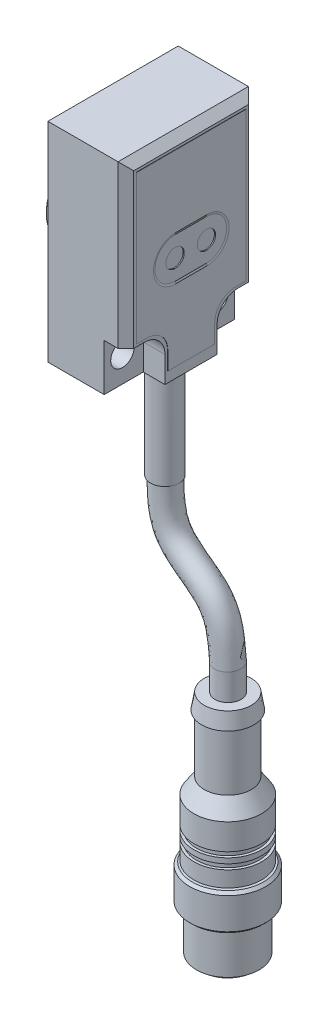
ISO-10303-21;
HEADER;
FILE_DESCRIPTION(('STEP AP214'),'2;1');
FILE_NAME('part.step','',(''),(''),'','','');
FILE_SCHEMA(('AUTOMOTIVE_DESIGN { 1 0 10303 214 1 1 1 1 }'));
ENDSEC;
DATA;
#1=APPLICATION_CONTEXT('core data for automotive mechanical design processes');
#2=APPLICATION_PROTOCOL_DEFINITION('international standard','automotive_design',2000,#1);
#3=PRODUCT_CONTEXT('',#1,'mechanical');
#4=PRODUCT('Part','Part','',(#3));
#5=PRODUCT_RELATED_PRODUCT_CATEGORY('part','',(#4));
#6=PRODUCT_DEFINITION_FORMATION('','',#4);
#7=PRODUCT_DEFINITION_CONTEXT('part definition',#1,'design');
#8=PRODUCT_DEFINITION('design','',#6,#7);
#9=PRODUCT_DEFINITION_SHAPE('','',#8);
#10=(LENGTH_UNIT() NAMED_UNIT(*) SI_UNIT(.MILLI.,.METRE.));
#11=(NAMED_UNIT(*) PLANE_ANGLE_UNIT() SI_UNIT($,.RADIAN.));
#12=(NAMED_UNIT(*) SI_UNIT($,.STERADIAN.) SOLID_ANGLE_UNIT());
#13=UNCERTAINTY_MEASURE_WITH_UNIT(LENGTH_MEASURE(1.E-05),#10,'distance_accuracy_value','');
#14=(GEOMETRIC_REPRESENTATION_CONTEXT(3) GLOBAL_UNCERTAINTY_ASSIGNED_CONTEXT((#13)) GLOBAL_UNIT_ASSIGNED_CONTEXT((#10,
#11,#12)) REPRESENTATION_CONTEXT('',''));
#15=CARTESIAN_POINT('',(0.,0.,0.));
#16=DIRECTION('',(0.,0.,1.));
#17=DIRECTION('',(1.,0.,0.));
#18=AXIS2_PLACEMENT_3D('',#15,#16,#17);
#19=CARTESIAN_POINT('',(22.,-84.5,0.));
#20=DIRECTION('',(0.,-1.,0.));
#21=DIRECTION('',(0.,0.,-1.));
#22=AXIS2_PLACEMENT_3D('',#19,#20,#21);
#23=PLANE('',#22);
#24=CARTESIAN_POINT('',(23.7131470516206,-84.5,-1.75));
#25=DIRECTION('',(0.,-1.,0.));
#26=DIRECTION('',(0.,0.,-1.));
#27=AXIS2_PLACEMENT_3D('',#24,#25,#26);
#28=CIRCLE('',#27,0.499999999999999);
#29=CARTESIAN_POINT('',(23.7131470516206,-84.5,-2.25));
#30=VERTEX_POINT('',#29);
#31=EDGE_CURVE('E1493',#30,#30,#28,.T.);
#32=ORIENTED_EDGE('',*,*,#31,.F.);
#33=EDGE_LOOP('',(#32));
#34=FACE_BOUND('',#33,.T.);
#35=CARTESIAN_POINT('',(20.25,-84.5,1.75));
#36=DIRECTION('',(0.,-1.,0.));
#37=DIRECTION('',(0.,0.,-1.));
#38=AXIS2_PLACEMENT_3D('',#35,#36,#37);
#39=CIRCLE('',#38,0.499999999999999);
#40=CARTESIAN_POINT('',(20.25,-84.5,1.25));
#41=VERTEX_POINT('',#40);
#42=EDGE_CURVE('E1492',#41,#41,#39,.T.);
#43=ORIENTED_EDGE('',*,*,#42,.F.);
#44=EDGE_LOOP('',(#43));
#45=FACE_BOUND('',#44,.T.);
#46=CARTESIAN_POINT('',(22.,-84.5,0.));
#47=DIRECTION('',(0.,-1.,0.));
#48=DIRECTION('',(0.,0.,-1.));
#49=AXIS2_PLACEMENT_3D('',#46,#47,#48);
#50=CIRCLE('',#49,4.25000000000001);
#51=CARTESIAN_POINT('',(22.,-84.5,-4.25000000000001));
#52=VERTEX_POINT('',#51);
#53=EDGE_CURVE('E1505',#52,#52,#50,.T.);
#54=ORIENTED_EDGE('',*,*,#53,.T.);
#55=EDGE_LOOP('',(#54));
#56=FACE_BOUND('',#55,.T.);
#57=CARTESIAN_POINT('',(23.7131470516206,-84.5,1.75));
#58=DIRECTION('',(0.,-1.,0.));
#59=DIRECTION('',(0.,0.,-1.));
#60=AXIS2_PLACEMENT_3D('',#57,#58,#59);
#61=CIRCLE('',#60,0.499999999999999);
#62=CARTESIAN_POINT('',(23.7131470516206,-84.5,1.25));
#63=VERTEX_POINT('',#62);
#64=EDGE_CURVE('E1490',#63,#63,#61,.T.);
#65=ORIENTED_EDGE('',*,*,#64,.F.);
#66=EDGE_LOOP('',(#65));
#67=FACE_BOUND('',#66,.T.);
#68=CARTESIAN_POINT('',(20.25,-84.5,-1.75));
#69=DIRECTION('',(0.,-1.,0.));
#70=DIRECTION('',(0.,0.,-1.));
#71=AXIS2_PLACEMENT_3D('',#68,#69,#70);
#72=CIRCLE('',#71,0.499999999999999);
#73=CARTESIAN_POINT('',(20.25,-84.5,-2.25));
#74=VERTEX_POINT('',#73);
#75=EDGE_CURVE('E1499',#74,#74,#72,.T.);
#76=ORIENTED_EDGE('',*,*,#75,.F.);
#77=EDGE_LOOP('',(#76));
#78=FACE_BOUND('',#77,.T.);
#79=ADVANCED_FACE('F348',(#34,#45,#56,#67,#78),#23,.T.);
#80=CARTESIAN_POINT('',(0.,0.,12.5));
#81=DIRECTION('',(0.,1.,0.));
#82=DIRECTION('',(0.,0.,1.));
#83=AXIS2_PLACEMENT_3D('',#80,#81,#82);
#84=PLANE('',#83);
#85=DIRECTION('',(0.,0.,-1.));
#86=VECTOR('',#85,1.);
#87=CARTESIAN_POINT('',(14.95,0.,12.5));
#88=LINE('',#87,#86);
#89=CARTESIAN_POINT('',(14.95,0.,5.));
#90=VERTEX_POINT('',#89);
#91=CARTESIAN_POINT('',(14.95,0.,-5.));
#92=VERTEX_POINT('',#91);
#93=EDGE_CURVE('E708',#90,#92,#88,.T.);
#94=ORIENTED_EDGE('',*,*,#93,.F.);
#95=DIRECTION('',(1.,0.,0.));
#96=VECTOR('',#95,1.);
#97=CARTESIAN_POINT('',(10.8,0.,5.));
#98=LINE('',#97,#96);
#99=CARTESIAN_POINT('',(10.8,0.,5.));
#100=VERTEX_POINT('',#99);
#101=EDGE_CURVE('E607',#100,#90,#98,.T.);
#102=ORIENTED_EDGE('',*,*,#101,.F.);
#103=DIRECTION('',(0.,0.,-1.));
#104=VECTOR('',#103,1.);
#105=CARTESIAN_POINT('',(10.8,0.,12.5));
#106=LINE('',#105,#104);
#107=CARTESIAN_POINT('',(10.8,0.,12.5));
#108=VERTEX_POINT('',#107);
#109=EDGE_CURVE('E597',#108,#100,#106,.T.);
#110=ORIENTED_EDGE('',*,*,#109,.F.);
#111=DIRECTION('',(1.,0.,0.));
#112=VECTOR('',#111,1.);
#113=CARTESIAN_POINT('',(0.,0.,12.5));
#114=LINE('',#113,#112);
#115=CARTESIAN_POINT('',(0.,0.,12.5));
#116=VERTEX_POINT('',#115);
#117=EDGE_CURVE('E739',#116,#108,#114,.T.);
#118=ORIENTED_EDGE('',*,*,#117,.F.);
#119=DIRECTION('',(0.,0.,-1.));
#120=VECTOR('',#119,1.);
#121=CARTESIAN_POINT('',(0.,0.,12.5));
#122=LINE('',#121,#120);
#123=CARTESIAN_POINT('',(0.,0.,-12.5));
#124=VERTEX_POINT('',#123);
#125=EDGE_CURVE('E747',#116,#124,#122,.T.);
#126=ORIENTED_EDGE('',*,*,#125,.T.);
#127=DIRECTION('',(1.,0.,0.));
#128=VECTOR('',#127,1.);
#129=CARTESIAN_POINT('',(0.,0.,-12.5));
#130=LINE('',#129,#128);
#131=CARTESIAN_POINT('',(10.8,0.,-12.5));
#132=VERTEX_POINT('',#131);
#133=EDGE_CURVE('E731',#124,#132,#130,.T.);
#134=ORIENTED_EDGE('',*,*,#133,.T.);
#135=DIRECTION('',(0.,0.,-1.));
#136=VECTOR('',#135,1.);
#137=CARTESIAN_POINT('',(10.8,0.,-12.5));
#138=LINE('',#137,#136);
#139=CARTESIAN_POINT('',(10.8,0.,-5.));
#140=VERTEX_POINT('',#139);
#141=EDGE_CURVE('E624',#140,#132,#138,.T.);
#142=ORIENTED_EDGE('',*,*,#141,.F.);
#143=DIRECTION('',(1.,0.,0.));
#144=VECTOR('',#143,1.);
#145=CARTESIAN_POINT('',(10.8,0.,-5.));
#146=LINE('',#145,#144);
#147=EDGE_CURVE('E627',#140,#92,#146,.T.);
#148=ORIENTED_EDGE('',*,*,#147,.T.);
#149=EDGE_LOOP('',(#94,#102,#110,#118,#126,#134,#142,#148));
#150=FACE_BOUND('',#149,.T.);
#151=CARTESIAN_POINT('',(9.95,0.,0.));
#152=DIRECTION('',(0.,1.,0.));
#153=DIRECTION('',(0.,0.,1.));
#154=AXIS2_PLACEMENT_3D('',#151,#152,#153);
#155=CIRCLE('',#154,2.75);
#156=CARTESIAN_POINT('',(9.95,0.,2.75));
#157=VERTEX_POINT('',#156);
#158=EDGE_CURVE('E792',#157,#157,#155,.F.);
#159=ORIENTED_EDGE('',*,*,#158,.F.);
#160=EDGE_LOOP('',(#159));
#161=FACE_BOUND('',#160,.T.);
#162=ADVANCED_FACE('F847',(#150,#161),#84,.F.);
#163=CARTESIAN_POINT('',(-5.,5.,9.));
#164=DIRECTION('',(1.,0.,0.));
#165=DIRECTION('',(0.,0.,-1.));
#166=AXIS2_PLACEMENT_3D('',#163,#164,#165);
#167=CYLINDRICAL_SURFACE('',#166,2.25);
#168=CARTESIAN_POINT('',(0.,5.,9.));
#169=DIRECTION('',(1.,0.,0.));
#170=DIRECTION('',(0.,0.,-1.));
#171=AXIS2_PLACEMENT_3D('',#168,#169,#170);
#172=CIRCLE('',#171,2.25);
#173=CARTESIAN_POINT('',(0.,5.,6.75));
#174=VERTEX_POINT('',#173);
#175=EDGE_CURVE('E642',#174,#174,#172,.T.);
#176=ORIENTED_EDGE('',*,*,#175,.F.);
#177=EDGE_LOOP('',(#176));
#178=FACE_BOUND('',#177,.T.);
#179=CARTESIAN_POINT('',(10.8,5.,9.));
#180=DIRECTION('',(1.,0.,0.));
#181=DIRECTION('',(0.,0.,-1.));
#182=AXIS2_PLACEMENT_3D('',#179,#180,#181);
#183=CIRCLE('',#182,2.25);
#184=CARTESIAN_POINT('',(10.8,5.,6.75));
#185=VERTEX_POINT('',#184);
#186=EDGE_CURVE('E606',#185,#185,#183,.F.);
#187=ORIENTED_EDGE('',*,*,#186,.F.);
#188=EDGE_LOOP('',(#187));
#189=FACE_BOUND('',#188,.T.);
#190=ADVANCED_FACE('F853',(#178,#189),#167,.F.);
#191=CARTESIAN_POINT('',(0.,0.,12.5));
#192=DIRECTION('',(1.,0.,0.));
#193=DIRECTION('',(0.,0.,-1.));
#194=AXIS2_PLACEMENT_3D('',#191,#192,#193);
#195=PLANE('',#194);
#196=CARTESIAN_POINT('',(0.,5.,-9.));
#197=DIRECTION('',(1.,0.,0.));
#198=DIRECTION('',(0.,0.,-1.));
#199=AXIS2_PLACEMENT_3D('',#196,#197,#198);
#200=CIRCLE('',#199,2.25);
#201=CARTESIAN_POINT('',(0.,5.,-11.25));
#202=VERTEX_POINT('',#201);
#203=EDGE_CURVE('E639',#202,#202,#200,.T.);
#204=ORIENTED_EDGE('',*,*,#203,.T.);
#205=EDGE_LOOP('',(#204));
#206=FACE_BOUND('',#205,.T.);
#207=ORIENTED_EDGE('',*,*,#175,.T.);
#208=EDGE_LOOP('',(#207));
#209=FACE_BOUND('',#208,.T.);
#210=DIRECTION('',(0.,0.,-1.));
#211=VECTOR('',#210,1.);
#212=CARTESIAN_POINT('',(0.,40.,12.5));
#213=LINE('',#212,#211);
#214=CARTESIAN_POINT('',(0.,40.,12.5));
#215=VERTEX_POINT('',#214);
#216=CARTESIAN_POINT('',(0.,40.,-12.5));
#217=VERTEX_POINT('',#216);
#218=EDGE_CURVE('E744',#215,#217,#213,.T.);
#219=ORIENTED_EDGE('',*,*,#218,.T.);
#220=DIRECTION('',(0.,-1.,0.));
#221=VECTOR('',#220,1.);
#222=CARTESIAN_POINT('',(0.,0.,-12.5));
#223=LINE('',#222,#221);
#224=EDGE_CURVE('E728',#217,#124,#223,.T.);
#225=ORIENTED_EDGE('',*,*,#224,.T.);
#226=ORIENTED_EDGE('',*,*,#125,.F.);
#227=DIRECTION('',(0.,-1.,0.));
#228=VECTOR('',#227,1.);
#229=CARTESIAN_POINT('',(0.,0.,12.5));
#230=LINE('',#229,#228);
#231=EDGE_CURVE('E736',#215,#116,#230,.T.);
#232=ORIENTED_EDGE('',*,*,#231,.F.);
#233=EDGE_LOOP('',(#219,#225,#226,#232));
#234=FACE_BOUND('',#233,.T.);
#235=CARTESIAN_POINT('',(0.,20.,0.));
#236=DIRECTION('',(1.,0.,0.));
#237=DIRECTION('',(0.,0.,-1.));
#238=AXIS2_PLACEMENT_3D('',#235,#236,#237);
#239=CIRCLE('',#238,8.);
#240=CARTESIAN_POINT('',(0.,20.,-8.));
#241=VERTEX_POINT('',#240);
#242=EDGE_CURVE('E749',#241,#241,#239,.F.);
#243=ORIENTED_EDGE('',*,*,#242,.F.);
#244=EDGE_LOOP('',(#243));
#245=FACE_BOUND('',#244,.T.);
#246=ADVANCED_FACE('F350',(#206,#209,#234,#245),#195,.F.);
#247=CARTESIAN_POINT('',(0.,40.,12.5));
#248=DIRECTION('',(0.,-1.,0.));
#249=DIRECTION('',(0.,0.,-1.));
#250=AXIS2_PLACEMENT_3D('',#247,#248,#249);
#251=PLANE('',#250);
#252=DIRECTION('',(-1.,0.,0.));
#253=VECTOR('',#252,1.);
#254=CARTESIAN_POINT('',(0.,40.,12.5));
#255=LINE('',#254,#253);
#256=CARTESIAN_POINT('',(13.45,40.,12.5));
#257=VERTEX_POINT('',#256);
#258=EDGE_CURVE('E742',#257,#215,#255,.T.);
#259=ORIENTED_EDGE('',*,*,#258,.F.);
#260=DIRECTION('',(0.,0.,-1.));
#261=VECTOR('',#260,1.);
#262=CARTESIAN_POINT('',(13.45,40.,-12.5));
#263=LINE('',#262,#261);
#264=CARTESIAN_POINT('',(13.45,40.,-12.5));
#265=VERTEX_POINT('',#264);
#266=EDGE_CURVE('E781',#257,#265,#263,.T.);
#267=ORIENTED_EDGE('',*,*,#266,.T.);
#268=DIRECTION('',(-1.,0.,0.));
#269=VECTOR('',#268,1.);
#270=CARTESIAN_POINT('',(0.,40.,-12.5));
#271=LINE('',#270,#269);
#272=EDGE_CURVE('E734',#265,#217,#271,.T.);
#273=ORIENTED_EDGE('',*,*,#272,.T.);
#274=ORIENTED_EDGE('',*,*,#218,.F.);
#275=EDGE_LOOP('',(#259,#267,#273,#274));
#276=FACE_BOUND('',#275,.T.);
#277=ADVANCED_FACE('F1155',(#276),#251,.F.);
#278=CARTESIAN_POINT('',(0.,40.,12.5));
#279=DIRECTION('',(0.,0.,-1.));
#280=DIRECTION('',(-1.,0.,0.));
#281=AXIS2_PLACEMENT_3D('',#278,#279,#280);
#282=PLANE('',#281);
#283=DIRECTION('',(1.,0.,0.));
#284=VECTOR('',#283,1.);
#285=CARTESIAN_POINT('',(10.8,9.,12.5));
#286=LINE('',#285,#284);
#287=CARTESIAN_POINT('',(10.8,9.,12.5));
#288=VERTEX_POINT('',#287);
#289=CARTESIAN_POINT('',(13.45,9.,12.5));
#290=VERTEX_POINT('',#289);
#291=EDGE_CURVE('E609',#288,#290,#286,.T.);
#292=ORIENTED_EDGE('',*,*,#291,.T.);
#293=DIRECTION('',(0.,1.,0.));
#294=VECTOR('',#293,1.);
#295=CARTESIAN_POINT('',(13.45,40.,12.5));
#296=LINE('',#295,#294);
#297=EDGE_CURVE('E784',#290,#257,#296,.T.);
#298=ORIENTED_EDGE('',*,*,#297,.T.);
#299=ORIENTED_EDGE('',*,*,#258,.T.);
#300=ORIENTED_EDGE('',*,*,#231,.T.);
#301=ORIENTED_EDGE('',*,*,#117,.T.);
#302=DIRECTION('',(0.,-1.,0.));
#303=VECTOR('',#302,1.);
#304=CARTESIAN_POINT('',(10.8,0.,12.5));
#305=LINE('',#304,#303);
#306=EDGE_CURVE('E595',#288,#108,#305,.T.);
#307=ORIENTED_EDGE('',*,*,#306,.F.);
#308=EDGE_LOOP('',(#292,#298,#299,#300,#301,#307));
#309=FACE_BOUND('',#308,.T.);
#310=ADVANCED_FACE('F1151',(#309),#282,.F.);
#311=CARTESIAN_POINT('',(0.,40.,-12.5));
#312=DIRECTION('',(0.,0.,-1.));
#313=DIRECTION('',(-1.,0.,0.));
#314=AXIS2_PLACEMENT_3D('',#311,#312,#313);
#315=PLANE('',#314);
#316=ORIENTED_EDGE('',*,*,#272,.F.);
#317=DIRECTION('',(0.,-1.,0.));
#318=VECTOR('',#317,1.);
#319=CARTESIAN_POINT('',(13.45,40.,-12.5));
#320=LINE('',#319,#318);
#321=CARTESIAN_POINT('',(13.45,8.99999999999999,-12.5));
#322=VERTEX_POINT('',#321);
#323=EDGE_CURVE('E777',#265,#322,#320,.T.);
#324=ORIENTED_EDGE('',*,*,#323,.T.);
#325=DIRECTION('',(1.,0.,0.));
#326=VECTOR('',#325,1.);
#327=CARTESIAN_POINT('',(10.8,8.99999999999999,-12.5));
#328=LINE('',#327,#326);
#329=CARTESIAN_POINT('',(10.8,8.99999999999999,-12.5));
#330=VERTEX_POINT('',#329);
#331=EDGE_CURVE('E626',#330,#322,#328,.T.);
#332=ORIENTED_EDGE('',*,*,#331,.F.);
#333=DIRECTION('',(0.,1.,0.));
#334=VECTOR('',#333,1.);
#335=CARTESIAN_POINT('',(10.8,0.,-12.5));
#336=LINE('',#335,#334);
#337=EDGE_CURVE('E612',#132,#330,#336,.T.);
#338=ORIENTED_EDGE('',*,*,#337,.F.);
#339=ORIENTED_EDGE('',*,*,#133,.F.);
#340=ORIENTED_EDGE('',*,*,#224,.F.);
#341=EDGE_LOOP('',(#316,#324,#332,#338,#339,#340));
#342=FACE_BOUND('',#341,.T.);
#343=ADVANCED_FACE('F1147',(#342),#315,.T.);
#344=CARTESIAN_POINT('',(14.95,40.,-12.5));
#345=DIRECTION('',(1.,0.,0.));
#346=DIRECTION('',(0.,0.,-1.));
#347=AXIS2_PLACEMENT_3D('',#344,#345,#346);
#348=PLANE('',#347);
#349=DIRECTION('',(0.,0.,1.));
#350=VECTOR('',#349,1.);
#351=CARTESIAN_POINT('',(14.95,8.99999999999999,-12.4999999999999));
#352=LINE('',#351,#350);
#353=CARTESIAN_POINT('',(14.95,9.,-11.));
#354=VERTEX_POINT('',#353);
#355=CARTESIAN_POINT('',(14.95,9.,-9.));
#356=VERTEX_POINT('',#355);
#357=EDGE_CURVE('E752',#354,#356,#352,.T.);
#358=ORIENTED_EDGE('',*,*,#357,.F.);
#359=DIRECTION('',(0.,1.,0.));
#360=VECTOR('',#359,1.);
#361=CARTESIAN_POINT('',(14.95,40.,-11.));
#362=LINE('',#361,#360);
#363=CARTESIAN_POINT('',(14.95,38.5,-11.));
#364=VERTEX_POINT('',#363);
#365=EDGE_CURVE('E774',#354,#364,#362,.T.);
#366=ORIENTED_EDGE('',*,*,#365,.T.);
#367=DIRECTION('',(0.,0.,1.));
#368=VECTOR('',#367,1.);
#369=CARTESIAN_POINT('',(14.95,38.5,12.5));
#370=LINE('',#369,#368);
#371=CARTESIAN_POINT('',(14.95,38.5,11.));
#372=VERTEX_POINT('',#371);
#373=EDGE_CURVE('E772',#364,#372,#370,.T.);
#374=ORIENTED_EDGE('',*,*,#373,.T.);
#375=DIRECTION('',(0.,-1.,0.));
#376=VECTOR('',#375,1.);
#377=CARTESIAN_POINT('',(14.95,9.,11.));
#378=LINE('',#377,#376);
#379=CARTESIAN_POINT('',(14.95,9.,11.));
#380=VERTEX_POINT('',#379);
#381=EDGE_CURVE('E770',#372,#380,#378,.T.);
#382=ORIENTED_EDGE('',*,*,#381,.T.);
#383=DIRECTION('',(0.,0.,1.));
#384=VECTOR('',#383,1.);
#385=CARTESIAN_POINT('',(14.95,9.,-12.5));
#386=LINE('',#385,#384);
#387=CARTESIAN_POINT('',(14.95,9.,9.));
#388=VERTEX_POINT('',#387);
#389=EDGE_CURVE('E761',#388,#380,#386,.T.);
#390=ORIENTED_EDGE('',*,*,#389,.F.);
#391=CARTESIAN_POINT('',(14.95,5.,9.));
#392=DIRECTION('',(1.,0.,0.));
#393=DIRECTION('',(0.,0.,-1.));
#394=AXIS2_PLACEMENT_3D('',#391,#392,#393);
#395=CIRCLE('',#394,4.);
#396=CARTESIAN_POINT('',(14.95,5.,5.));
#397=VERTEX_POINT('',#396);
#398=EDGE_CURVE('E765',#397,#388,#395,.T.);
#399=ORIENTED_EDGE('',*,*,#398,.F.);
#400=DIRECTION('',(0.,1.,0.));
#401=VECTOR('',#400,1.);
#402=CARTESIAN_POINT('',(14.95,40.,5.00000000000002));
#403=LINE('',#402,#401);
#404=EDGE_CURVE('E768',#90,#397,#403,.T.);
#405=ORIENTED_EDGE('',*,*,#404,.F.);
#406=ORIENTED_EDGE('',*,*,#93,.T.);
#407=DIRECTION('',(0.,-1.,0.));
#408=VECTOR('',#407,1.);
#409=CARTESIAN_POINT('',(14.95,40.,-5.00000000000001));
#410=LINE('',#409,#408);
#411=CARTESIAN_POINT('',(14.95,5.,-5.));
#412=VERTEX_POINT('',#411);
#413=EDGE_CURVE('E758',#412,#92,#410,.T.);
#414=ORIENTED_EDGE('',*,*,#413,.F.);
#415=CARTESIAN_POINT('',(14.95,5.,-9.));
#416=DIRECTION('',(1.,0.,0.));
#417=DIRECTION('',(0.,0.,-1.));
#418=AXIS2_PLACEMENT_3D('',#415,#416,#417);
#419=CIRCLE('',#418,4.);
#420=EDGE_CURVE('E756',#356,#412,#419,.T.);
#421=ORIENTED_EDGE('',*,*,#420,.F.);
#422=EDGE_LOOP('',(#358,#366,#374,#382,#390,#399,#405,#406,#414,#421));
#423=FACE_BOUND('',#422,.T.);
#424=DIRECTION('',(0.,0.,1.));
#425=VECTOR('',#424,1.);
#426=CARTESIAN_POINT('',(14.95,38.,10.5));
#427=LINE('',#426,#425);
#428=CARTESIAN_POINT('',(14.95,38.,-10.5));
#429=VERTEX_POINT('',#428);
#430=CARTESIAN_POINT('',(14.95,38.,10.5));
#431=VERTEX_POINT('',#430);
#432=EDGE_CURVE('E702',#429,#431,#427,.T.);
#433=ORIENTED_EDGE('',*,*,#432,.F.);
#434=DIRECTION('',(0.,1.,0.));
#435=VECTOR('',#434,1.);
#436=CARTESIAN_POINT('',(14.95,38.,-10.5));
#437=LINE('',#436,#435);
#438=CARTESIAN_POINT('',(14.95,9.5,-10.5));
#439=VERTEX_POINT('',#438);
#440=EDGE_CURVE('E699',#439,#429,#437,.T.);
#441=ORIENTED_EDGE('',*,*,#440,.F.);
#442=DIRECTION('',(0.,0.,-1.));
#443=VECTOR('',#442,1.);
#444=CARTESIAN_POINT('',(14.95,9.5,-8.5));
#445=LINE('',#444,#443);
#446=CARTESIAN_POINT('',(14.95,9.5,-8.5));
#447=VERTEX_POINT('',#446);
#448=EDGE_CURVE('E696',#447,#439,#445,.T.);
#449=ORIENTED_EDGE('',*,*,#448,.F.);
#450=CARTESIAN_POINT('',(14.95,5.5,-8.5));
#451=DIRECTION('',(-1.,0.,0.));
#452=DIRECTION('',(0.,0.,-1.));
#453=AXIS2_PLACEMENT_3D('',#450,#451,#452);
#454=CIRCLE('',#453,4.);
#455=CARTESIAN_POINT('',(14.95,5.5,-4.5));
#456=VERTEX_POINT('',#455);
#457=EDGE_CURVE('E693',#456,#447,#454,.T.);
#458=ORIENTED_EDGE('',*,*,#457,.F.);
#459=DIRECTION('',(0.,1.,0.));
#460=VECTOR('',#459,1.);
#461=CARTESIAN_POINT('',(14.95,2.,-4.5));
#462=LINE('',#461,#460);
#463=CARTESIAN_POINT('',(14.95,2.,-4.5));
#464=VERTEX_POINT('',#463);
#465=EDGE_CURVE('E690',#464,#456,#462,.T.);
#466=ORIENTED_EDGE('',*,*,#465,.F.);
#467=DIRECTION('',(0.,0.,-1.));
#468=VECTOR('',#467,1.);
#469=CARTESIAN_POINT('',(14.95,2.,4.5));
#470=LINE('',#469,#468);
#471=CARTESIAN_POINT('',(14.95,2.,4.5));
#472=VERTEX_POINT('',#471);
#473=EDGE_CURVE('E687',#472,#464,#470,.T.);
#474=ORIENTED_EDGE('',*,*,#473,.F.);
#475=DIRECTION('',(0.,-1.,0.));
#476=VECTOR('',#475,1.);
#477=CARTESIAN_POINT('',(14.95,2.,4.5));
#478=LINE('',#477,#476);
#479=CARTESIAN_POINT('',(14.95,5.5,4.5));
#480=VERTEX_POINT('',#479);
#481=EDGE_CURVE('E684',#480,#472,#478,.T.);
#482=ORIENTED_EDGE('',*,*,#481,.F.);
#483=CARTESIAN_POINT('',(14.95,5.5,8.5));
#484=DIRECTION('',(-1.,0.,0.));
#485=DIRECTION('',(0.,0.,1.));
#486=AXIS2_PLACEMENT_3D('',#483,#484,#485);
#487=CIRCLE('',#486,4.);
#488=CARTESIAN_POINT('',(14.95,9.5,8.5));
#489=VERTEX_POINT('',#488);
#490=EDGE_CURVE('E681',#489,#480,#487,.T.);
#491=ORIENTED_EDGE('',*,*,#490,.F.);
#492=DIRECTION('',(0.,0.,-1.));
#493=VECTOR('',#492,1.);
#494=CARTESIAN_POINT('',(14.95,9.5,10.5));
#495=LINE('',#494,#493);
#496=CARTESIAN_POINT('',(14.95,9.5,10.5));
#497=VERTEX_POINT('',#496);
#498=EDGE_CURVE('E678',#497,#489,#495,.T.);
#499=ORIENTED_EDGE('',*,*,#498,.F.);
#500=DIRECTION('',(0.,-1.,0.));
#501=VECTOR('',#500,1.);
#502=CARTESIAN_POINT('',(14.95,38.,10.5));
#503=LINE('',#502,#501);
#504=EDGE_CURVE('E675',#431,#497,#503,.T.);
#505=ORIENTED_EDGE('',*,*,#504,.F.);
#506=EDGE_LOOP('',(#433,#441,#449,#458,#466,#474,#482,#491,#499,#505));
#507=FACE_BOUND('',#506,.T.);
#508=ADVANCED_FACE('F1143',(#423,#507),#348,.T.);
#509=CARTESIAN_POINT('',(14.95,38.,10.5));
#510=DIRECTION('',(0.,0.,1.));
#511=DIRECTION('',(0.,-1.,0.));
#512=AXIS2_PLACEMENT_3D('',#509,#510,#511);
#513=PLANE('',#512);
#514=DIRECTION('',(0.,-1.,0.));
#515=VECTOR('',#514,1.);
#516=CARTESIAN_POINT('',(15.,38.,10.5));
#517=LINE('',#516,#515);
#518=CARTESIAN_POINT('',(15.,38.,10.5));
#519=VERTEX_POINT('',#518);
#520=CARTESIAN_POINT('',(15.,9.5,10.5));
#521=VERTEX_POINT('',#520);
#522=EDGE_CURVE('E645',#519,#521,#517,.T.);
#523=ORIENTED_EDGE('',*,*,#522,.F.);
#524=DIRECTION('',(1.,0.,0.));
#525=VECTOR('',#524,1.);
#526=CARTESIAN_POINT('',(14.95,38.,10.5));
#527=LINE('',#526,#525);
#528=EDGE_CURVE('E706',#431,#519,#527,.T.);
#529=ORIENTED_EDGE('',*,*,#528,.F.);
#530=ORIENTED_EDGE('',*,*,#504,.T.);
#531=DIRECTION('',(1.,0.,0.));
#532=VECTOR('',#531,1.);
#533=CARTESIAN_POINT('',(14.95,9.5,10.5));
#534=LINE('',#533,#532);
#535=EDGE_CURVE('E705',#497,#521,#534,.T.);
#536=ORIENTED_EDGE('',*,*,#535,.T.);
#537=EDGE_LOOP('',(#523,#529,#530,#536));
#538=FACE_BOUND('',#537,.T.);
#539=ADVANCED_FACE('F1108',(#538),#513,.T.);
#540=CARTESIAN_POINT('',(14.95,38.,10.5));
#541=DIRECTION('',(0.,1.,0.));
#542=DIRECTION('',(0.,0.,1.));
#543=AXIS2_PLACEMENT_3D('',#540,#541,#542);
#544=PLANE('',#543);
#545=DIRECTION('',(0.,0.,1.));
#546=VECTOR('',#545,1.);
#547=CARTESIAN_POINT('',(15.,38.,10.5));
#548=LINE('',#547,#546);
#549=CARTESIAN_POINT('',(15.,38.,-10.5));
#550=VERTEX_POINT('',#549);
#551=EDGE_CURVE('E672',#550,#519,#548,.T.);
#552=ORIENTED_EDGE('',*,*,#551,.F.);
#553=DIRECTION('',(1.,0.,0.));
#554=VECTOR('',#553,1.);
#555=CARTESIAN_POINT('',(14.95,38.,-10.5));
#556=LINE('',#555,#554);
#557=EDGE_CURVE('E709',#429,#550,#556,.T.);
#558=ORIENTED_EDGE('',*,*,#557,.F.);
#559=ORIENTED_EDGE('',*,*,#432,.T.);
#560=ORIENTED_EDGE('',*,*,#528,.T.);
#561=EDGE_LOOP('',(#552,#558,#559,#560));
#562=FACE_BOUND('',#561,.T.);
#563=ADVANCED_FACE('F1104',(#562),#544,.T.);
#564=CARTESIAN_POINT('',(14.95,38.,-10.5));
#565=DIRECTION('',(0.,0.,-1.));
#566=DIRECTION('',(0.,1.,0.));
#567=AXIS2_PLACEMENT_3D('',#564,#565,#566);
#568=PLANE('',#567);
#569=DIRECTION('',(0.,1.,0.));
#570=VECTOR('',#569,1.);
#571=CARTESIAN_POINT('',(15.,38.,-10.5));
#572=LINE('',#571,#570);
#573=CARTESIAN_POINT('',(15.,9.5,-10.5));
#574=VERTEX_POINT('',#573);
#575=EDGE_CURVE('E669',#574,#550,#572,.T.);
#576=ORIENTED_EDGE('',*,*,#575,.F.);
#577=DIRECTION('',(1.,0.,0.));
#578=VECTOR('',#577,1.);
#579=CARTESIAN_POINT('',(14.95,9.5,-10.5));
#580=LINE('',#579,#578);
#581=EDGE_CURVE('E711',#439,#574,#580,.T.);
#582=ORIENTED_EDGE('',*,*,#581,.F.);
#583=ORIENTED_EDGE('',*,*,#440,.T.);
#584=ORIENTED_EDGE('',*,*,#557,.T.);
#585=EDGE_LOOP('',(#576,#582,#583,#584));
#586=FACE_BOUND('',#585,.T.);
#587=ADVANCED_FACE('F1107',(#586),#568,.T.);
#588=CARTESIAN_POINT('',(14.95,9.5,-8.5));
#589=DIRECTION('',(0.,-1.,0.));
#590=DIRECTION('',(0.,0.,-1.));
#591=AXIS2_PLACEMENT_3D('',#588,#589,#590);
#592=PLANE('',#591);
#593=DIRECTION('',(0.,0.,-1.));
#594=VECTOR('',#593,1.);
#595=CARTESIAN_POINT('',(15.,9.5,-8.5));
#596=LINE('',#595,#594);
#597=CARTESIAN_POINT('',(15.,9.5,-8.5));
#598=VERTEX_POINT('',#597);
#599=EDGE_CURVE('E666',#598,#574,#596,.T.);
#600=ORIENTED_EDGE('',*,*,#599,.F.);
#601=DIRECTION('',(1.,0.,0.));
#602=VECTOR('',#601,1.);
#603=CARTESIAN_POINT('',(14.95,9.5,-8.5));
#604=LINE('',#603,#602);
#605=EDGE_CURVE('E713',#447,#598,#604,.T.);
#606=ORIENTED_EDGE('',*,*,#605,.F.);
#607=ORIENTED_EDGE('',*,*,#448,.T.);
#608=ORIENTED_EDGE('',*,*,#581,.T.);
#609=EDGE_LOOP('',(#600,#606,#607,#608));
#610=FACE_BOUND('',#609,.T.);
#611=ADVANCED_FACE('F1112',(#610),#592,.T.);
#612=CARTESIAN_POINT('',(14.95,5.5,-8.5));
#613=DIRECTION('',(1.,0.,0.));
#614=DIRECTION('',(0.,0.,-1.));
#615=AXIS2_PLACEMENT_3D('',#612,#613,#614);
#616=CYLINDRICAL_SURFACE('',#615,4.);
#617=CARTESIAN_POINT('',(15.,5.5,-8.5));
#618=DIRECTION('',(-1.,0.,0.));
#619=DIRECTION('',(0.,0.,-1.));
#620=AXIS2_PLACEMENT_3D('',#617,#618,#619);
#621=CIRCLE('',#620,4.);
#622=CARTESIAN_POINT('',(15.,5.5,-4.5));
#623=VERTEX_POINT('',#622);
#624=EDGE_CURVE('E663',#623,#598,#621,.T.);
#625=ORIENTED_EDGE('',*,*,#624,.F.);
#626=DIRECTION('',(1.,0.,0.));
#627=VECTOR('',#626,1.);
#628=CARTESIAN_POINT('',(14.95,5.5,-4.5));
#629=LINE('',#628,#627);
#630=EDGE_CURVE('E715',#456,#623,#629,.T.);
#631=ORIENTED_EDGE('',*,*,#630,.F.);
#632=ORIENTED_EDGE('',*,*,#457,.T.);
#633=ORIENTED_EDGE('',*,*,#605,.T.);
#634=EDGE_LOOP('',(#625,#631,#632,#633));
#635=FACE_BOUND('',#634,.T.);
#636=ADVANCED_FACE('F1116',(#635),#616,.F.);
#637=CARTESIAN_POINT('',(14.95,2.,-4.5));
#638=DIRECTION('',(0.,0.,-1.));
#639=DIRECTION('',(-1.,0.,0.));
#640=AXIS2_PLACEMENT_3D('',#637,#638,#639);
#641=PLANE('',#640);
#642=DIRECTION('',(0.,1.,0.));
#643=VECTOR('',#642,1.);
#644=CARTESIAN_POINT('',(15.,2.,-4.5));
#645=LINE('',#644,#643);
#646=CARTESIAN_POINT('',(15.,2.,-4.5));
#647=VERTEX_POINT('',#646);
#648=EDGE_CURVE('E660',#647,#623,#645,.T.);
#649=ORIENTED_EDGE('',*,*,#648,.F.);
#650=DIRECTION('',(1.,0.,0.));
#651=VECTOR('',#650,1.);
#652=CARTESIAN_POINT('',(14.95,2.,-4.5));
#653=LINE('',#652,#651);
#654=EDGE_CURVE('E717',#464,#647,#653,.T.);
#655=ORIENTED_EDGE('',*,*,#654,.F.);
#656=ORIENTED_EDGE('',*,*,#465,.T.);
#657=ORIENTED_EDGE('',*,*,#630,.T.);
#658=EDGE_LOOP('',(#649,#655,#656,#657));
#659=FACE_BOUND('',#658,.T.);
#660=ADVANCED_FACE('F1120',(#659),#641,.T.);
#661=CARTESIAN_POINT('',(14.95,2.,4.5));
#662=DIRECTION('',(0.,-1.,0.));
#663=DIRECTION('',(0.,0.,-1.));
#664=AXIS2_PLACEMENT_3D('',#661,#662,#663);
#665=PLANE('',#664);
#666=DIRECTION('',(0.,0.,-1.));
#667=VECTOR('',#666,1.);
#668=CARTESIAN_POINT('',(15.,2.,4.5));
#669=LINE('',#668,#667);
#670=CARTESIAN_POINT('',(15.,2.,4.5));
#671=VERTEX_POINT('',#670);
#672=EDGE_CURVE('E657',#671,#647,#669,.T.);
#673=ORIENTED_EDGE('',*,*,#672,.F.);
#674=DIRECTION('',(1.,0.,0.));
#675=VECTOR('',#674,1.);
#676=CARTESIAN_POINT('',(14.95,2.,4.5));
#677=LINE('',#676,#675);
#678=EDGE_CURVE('E719',#472,#671,#677,.T.);
#679=ORIENTED_EDGE('',*,*,#678,.F.);
#680=ORIENTED_EDGE('',*,*,#473,.T.);
#681=ORIENTED_EDGE('',*,*,#654,.T.);
#682=EDGE_LOOP('',(#673,#679,#680,#681));
#683=FACE_BOUND('',#682,.T.);
#684=ADVANCED_FACE('F1124',(#683),#665,.T.);
#685=CARTESIAN_POINT('',(14.95,2.,4.5));
#686=DIRECTION('',(0.,0.,1.));
#687=DIRECTION('',(0.,-1.,0.));
#688=AXIS2_PLACEMENT_3D('',#685,#686,#687);
#689=PLANE('',#688);
#690=DIRECTION('',(0.,-1.,0.));
#691=VECTOR('',#690,1.);
#692=CARTESIAN_POINT('',(15.,2.,4.5));
#693=LINE('',#692,#691);
#694=CARTESIAN_POINT('',(15.,5.5,4.5));
#695=VERTEX_POINT('',#694);
#696=EDGE_CURVE('E654',#695,#671,#693,.T.);
#697=ORIENTED_EDGE('',*,*,#696,.F.);
#698=DIRECTION('',(1.,0.,0.));
#699=VECTOR('',#698,1.);
#700=CARTESIAN_POINT('',(14.95,5.5,4.5));
#701=LINE('',#700,#699);
#702=EDGE_CURVE('E721',#480,#695,#701,.T.);
#703=ORIENTED_EDGE('',*,*,#702,.F.);
#704=ORIENTED_EDGE('',*,*,#481,.T.);
#705=ORIENTED_EDGE('',*,*,#678,.T.);
#706=EDGE_LOOP('',(#697,#703,#704,#705));
#707=FACE_BOUND('',#706,.T.);
#708=ADVANCED_FACE('F1128',(#707),#689,.T.);
#709=CARTESIAN_POINT('',(14.95,5.5,8.5));
#710=DIRECTION('',(1.,0.,0.));
#711=DIRECTION('',(0.,0.,-1.));
#712=AXIS2_PLACEMENT_3D('',#709,#710,#711);
#713=CYLINDRICAL_SURFACE('',#712,4.);
#714=CARTESIAN_POINT('',(15.,5.5,8.5));
#715=DIRECTION('',(-1.,0.,0.));
#716=DIRECTION('',(0.,0.,1.));
#717=AXIS2_PLACEMENT_3D('',#714,#715,#716);
#718=CIRCLE('',#717,4.);
#719=CARTESIAN_POINT('',(15.,9.5,8.5));
#720=VERTEX_POINT('',#719);
#721=EDGE_CURVE('E651',#720,#695,#718,.T.);
#722=ORIENTED_EDGE('',*,*,#721,.F.);
#723=DIRECTION('',(1.,0.,0.));
#724=VECTOR('',#723,1.);
#725=CARTESIAN_POINT('',(14.95,9.5,8.5));
#726=LINE('',#725,#724);
#727=EDGE_CURVE('E723',#489,#720,#726,.T.);
#728=ORIENTED_EDGE('',*,*,#727,.F.);
#729=ORIENTED_EDGE('',*,*,#490,.T.);
#730=ORIENTED_EDGE('',*,*,#702,.T.);
#731=EDGE_LOOP('',(#722,#728,#729,#730));
#732=FACE_BOUND('',#731,.T.);
#733=ADVANCED_FACE('F1132',(#732),#713,.F.);
#734=CARTESIAN_POINT('',(14.95,9.5,10.5));
#735=DIRECTION('',(0.,-1.,0.));
#736=DIRECTION('',(0.,0.,-1.));
#737=AXIS2_PLACEMENT_3D('',#734,#735,#736);
#738=PLANE('',#737);
#739=DIRECTION('',(0.,0.,-1.));
#740=VECTOR('',#739,1.);
#741=CARTESIAN_POINT('',(15.,9.5,10.5));
#742=LINE('',#741,#740);
#743=EDGE_CURVE('E648',#521,#720,#742,.T.);
#744=ORIENTED_EDGE('',*,*,#743,.F.);
#745=ORIENTED_EDGE('',*,*,#535,.F.);
#746=ORIENTED_EDGE('',*,*,#498,.T.);
#747=ORIENTED_EDGE('',*,*,#727,.T.);
#748=EDGE_LOOP('',(#744,#745,#746,#747));
#749=FACE_BOUND('',#748,.T.);
#750=ADVANCED_FACE('F1136',(#749),#738,.T.);
#751=CARTESIAN_POINT('',(15.,0.,12.5));
#752=DIRECTION('',(-1.,0.,0.));
#753=DIRECTION('',(0.,0.,1.));
#754=AXIS2_PLACEMENT_3D('',#751,#752,#753);
#755=PLANE('',#754);
#756=DIRECTION('',(0.,0.,-1.));
#757=VECTOR('',#756,1.);
#758=CARTESIAN_POINT('',(15.,15.75,3.));
#759=LINE('',#758,#757);
#760=CARTESIAN_POINT('',(15.,15.75,3.));
#761=VERTEX_POINT('',#760);
#762=CARTESIAN_POINT('',(15.,15.75,-3.));
#763=VERTEX_POINT('',#762);
#764=EDGE_CURVE('E549',#761,#763,#759,.T.);
#765=ORIENTED_EDGE('',*,*,#764,.F.);
#766=CARTESIAN_POINT('',(15.,20.,3.));
#767=DIRECTION('',(1.,0.,0.));
#768=DIRECTION('',(0.,0.,-1.));
#769=AXIS2_PLACEMENT_3D('',#766,#767,#768);
#770=CIRCLE('',#769,4.25);
#771=CARTESIAN_POINT('',(15.,24.25,3.));
#772=VERTEX_POINT('',#771);
#773=EDGE_CURVE('E363',#772,#761,#770,.T.);
#774=ORIENTED_EDGE('',*,*,#773,.F.);
#775=DIRECTION('',(0.,0.,1.));
#776=VECTOR('',#775,1.);
#777=CARTESIAN_POINT('',(15.,24.25,3.));
#778=LINE('',#777,#776);
#779=CARTESIAN_POINT('',(15.,24.25,-3.));
#780=VERTEX_POINT('',#779);
#781=EDGE_CURVE('E556',#780,#772,#778,.T.);
#782=ORIENTED_EDGE('',*,*,#781,.F.);
#783=CARTESIAN_POINT('',(15.,20.,-3.));
#784=DIRECTION('',(1.,0.,0.));
#785=DIRECTION('',(0.,0.,-1.));
#786=AXIS2_PLACEMENT_3D('',#783,#784,#785);
#787=CIRCLE('',#786,4.25);
#788=EDGE_CURVE('E538',#763,#780,#787,.T.);
#789=ORIENTED_EDGE('',*,*,#788,.F.);
#790=EDGE_LOOP('',(#765,#774,#782,#789));
#791=FACE_BOUND('',#790,.T.);
#792=ORIENTED_EDGE('',*,*,#522,.T.);
#793=ORIENTED_EDGE('',*,*,#743,.T.);
#794=ORIENTED_EDGE('',*,*,#721,.T.);
#795=ORIENTED_EDGE('',*,*,#696,.T.);
#796=ORIENTED_EDGE('',*,*,#672,.T.);
#797=ORIENTED_EDGE('',*,*,#648,.T.);
#798=ORIENTED_EDGE('',*,*,#624,.T.);
#799=ORIENTED_EDGE('',*,*,#599,.T.);
#800=ORIENTED_EDGE('',*,*,#575,.T.);
#801=ORIENTED_EDGE('',*,*,#551,.T.);
#802=EDGE_LOOP('',(#792,#793,#794,#795,#796,#797,#798,#799,#800,#801));
#803=FACE_BOUND('',#802,.T.);
#804=ADVANCED_FACE('F553',(#791,#803),#755,.F.);
#805=CARTESIAN_POINT('',(-5.,20.,0.));
#806=DIRECTION('',(1.,0.,0.));
#807=DIRECTION('',(0.,0.,-1.));
#808=AXIS2_PLACEMENT_3D('',#805,#806,#807);
#809=CYLINDRICAL_SURFACE('',#808,8.);
#810=CARTESIAN_POINT('',(-4.8,20.,0.));
#811=DIRECTION('',(-1.,0.,0.));
#812=DIRECTION('',(0.,0.,1.));
#813=AXIS2_PLACEMENT_3D('',#810,#811,#812);
#814=CIRCLE('',#813,8.);
#815=CARTESIAN_POINT('',(-4.8,20.,-8.));
#816=VERTEX_POINT('',#815);
#817=EDGE_CURVE('E789',#816,#816,#814,.F.);
#818=ORIENTED_EDGE('',*,*,#817,.T.);
#819=EDGE_LOOP('',(#818));
#820=FACE_BOUND('',#819,.T.);
#821=ORIENTED_EDGE('',*,*,#242,.T.);
#822=EDGE_LOOP('',(#821));
#823=FACE_BOUND('',#822,.T.);
#824=ADVANCED_FACE('F1099',(#820,#823),#809,.T.);
#825=CARTESIAN_POINT('',(-5.,20.,0.));
#826=DIRECTION('',(-1.,0.,0.));
#827=DIRECTION('',(0.,0.,1.));
#828=AXIS2_PLACEMENT_3D('',#825,#826,#827);
#829=PLANE('',#828);
#830=CARTESIAN_POINT('',(-5.,16.,0.));
#831=DIRECTION('',(-1.,0.,0.));
#832=DIRECTION('',(0.,0.,1.));
#833=AXIS2_PLACEMENT_3D('',#830,#831,#832);
#834=CIRCLE('',#833,3.75);
#835=CARTESIAN_POINT('',(-5.,16.,3.75));
#836=VERTEX_POINT('',#835);
#837=EDGE_CURVE('E1587',#836,#836,#834,.T.);
#838=ORIENTED_EDGE('',*,*,#837,.F.);
#839=EDGE_LOOP('',(#838));
#840=FACE_BOUND('',#839,.T.);
#841=CARTESIAN_POINT('',(-5.,24.,0.));
#842=DIRECTION('',(-1.,0.,0.));
#843=DIRECTION('',(0.,0.,1.));
#844=AXIS2_PLACEMENT_3D('',#841,#842,#843);
#845=CIRCLE('',#844,3.75);
#846=CARTESIAN_POINT('',(-5.,24.,3.75));
#847=VERTEX_POINT('',#846);
#848=EDGE_CURVE('E1593',#847,#847,#845,.T.);
#849=ORIENTED_EDGE('',*,*,#848,.F.);
#850=EDGE_LOOP('',(#849));
#851=FACE_BOUND('',#850,.T.);
#852=CARTESIAN_POINT('',(-5.,20.,0.));
#853=DIRECTION('',(-1.,0.,0.));
#854=DIRECTION('',(0.,0.,1.));
#855=AXIS2_PLACEMENT_3D('',#852,#853,#854);
#856=CIRCLE('',#855,7.8);
#857=CARTESIAN_POINT('',(-5.,20.,-7.8));
#858=VERTEX_POINT('',#857);
#859=EDGE_CURVE('E786',#858,#858,#856,.T.);
#860=ORIENTED_EDGE('',*,*,#859,.T.);
#861=EDGE_LOOP('',(#860));
#862=FACE_BOUND('',#861,.T.);
#863=ADVANCED_FACE('F1092',(#840,#851,#862),#829,.T.);
#864=CARTESIAN_POINT('',(-5.,5.,-9.));
#865=DIRECTION('',(1.,0.,0.));
#866=DIRECTION('',(0.,0.,-1.));
#867=AXIS2_PLACEMENT_3D('',#864,#865,#866);
#868=CYLINDRICAL_SURFACE('',#867,2.25);
#869=CARTESIAN_POINT('',(10.8,5.,-9.));
#870=DIRECTION('',(-1.,0.,0.));
#871=DIRECTION('',(0.,0.,1.));
#872=AXIS2_PLACEMENT_3D('',#869,#870,#871);
#873=CIRCLE('',#872,2.25);
#874=CARTESIAN_POINT('',(10.8,5.,-6.75));
#875=VERTEX_POINT('',#874);
#876=EDGE_CURVE('E630',#875,#875,#873,.F.);
#877=ORIENTED_EDGE('',*,*,#876,.T.);
#878=EDGE_LOOP('',(#877));
#879=FACE_BOUND('',#878,.T.);
#880=ORIENTED_EDGE('',*,*,#203,.F.);
#881=EDGE_LOOP('',(#880));
#882=FACE_BOUND('',#881,.T.);
#883=ADVANCED_FACE('F1078',(#879,#882),#868,.F.);
#884=CARTESIAN_POINT('',(10.8,5.,-9.));
#885=DIRECTION('',(-1.,0.,0.));
#886=DIRECTION('',(0.,0.,1.));
#887=AXIS2_PLACEMENT_3D('',#884,#885,#886);
#888=PLANE('',#887);
#889=ORIENTED_EDGE('',*,*,#337,.T.);
#890=DIRECTION('',(0.,0.,1.));
#891=VECTOR('',#890,1.);
#892=CARTESIAN_POINT('',(10.8,8.99999999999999,-12.5));
#893=LINE('',#892,#891);
#894=CARTESIAN_POINT('',(10.8,9.,-9.));
#895=VERTEX_POINT('',#894);
#896=EDGE_CURVE('E615',#330,#895,#893,.T.);
#897=ORIENTED_EDGE('',*,*,#896,.T.);
#898=CARTESIAN_POINT('',(10.8,5.,-9.));
#899=DIRECTION('',(1.,0.,0.));
#900=DIRECTION('',(0.,0.,1.));
#901=AXIS2_PLACEMENT_3D('',#898,#899,#900);
#902=CIRCLE('',#901,4.);
#903=CARTESIAN_POINT('',(10.8,5.,-5.));
#904=VERTEX_POINT('',#903);
#905=EDGE_CURVE('E618',#895,#904,#902,.T.);
#906=ORIENTED_EDGE('',*,*,#905,.T.);
#907=DIRECTION('',(0.,-1.,0.));
#908=VECTOR('',#907,1.);
#909=CARTESIAN_POINT('',(10.8,5.,-5.));
#910=LINE('',#909,#908);
#911=EDGE_CURVE('E621',#904,#140,#910,.T.);
#912=ORIENTED_EDGE('',*,*,#911,.T.);
#913=ORIENTED_EDGE('',*,*,#141,.T.);
#914=EDGE_LOOP('',(#889,#897,#906,#912,#913));
#915=FACE_BOUND('',#914,.T.);
#916=ORIENTED_EDGE('',*,*,#876,.F.);
#917=EDGE_LOOP('',(#916));
#918=FACE_BOUND('',#917,.T.);
#919=ADVANCED_FACE('F1074',(#915,#918),#888,.F.);
#920=CARTESIAN_POINT('',(10.8,5.,-5.));
#921=DIRECTION('',(0.,0.,1.));
#922=DIRECTION('',(0.,-1.,0.));
#923=AXIS2_PLACEMENT_3D('',#920,#921,#922);
#924=PLANE('',#923);
#925=ORIENTED_EDGE('',*,*,#413,.T.);
#926=ORIENTED_EDGE('',*,*,#147,.F.);
#927=ORIENTED_EDGE('',*,*,#911,.F.);
#928=DIRECTION('',(1.,0.,0.));
#929=VECTOR('',#928,1.);
#930=CARTESIAN_POINT('',(10.8,5.,-5.));
#931=LINE('',#930,#929);
#932=EDGE_CURVE('E631',#904,#412,#931,.T.);
#933=ORIENTED_EDGE('',*,*,#932,.T.);
#934=EDGE_LOOP('',(#925,#926,#927,#933));
#935=FACE_BOUND('',#934,.T.);
#936=ADVANCED_FACE('F1077',(#935),#924,.F.);
#937=CARTESIAN_POINT('',(10.8,5.,-9.));
#938=DIRECTION('',(1.,0.,0.));
#939=DIRECTION('',(0.,0.,-1.));
#940=AXIS2_PLACEMENT_3D('',#937,#938,#939);
#941=CYLINDRICAL_SURFACE('',#940,4.);
#942=ORIENTED_EDGE('',*,*,#420,.T.);
#943=ORIENTED_EDGE('',*,*,#932,.F.);
#944=ORIENTED_EDGE('',*,*,#905,.F.);
#945=DIRECTION('',(1.,0.,0.));
#946=VECTOR('',#945,1.);
#947=CARTESIAN_POINT('',(10.8,9.,-9.));
#948=LINE('',#947,#946);
#949=EDGE_CURVE('E634',#895,#356,#948,.T.);
#950=ORIENTED_EDGE('',*,*,#949,.T.);
#951=EDGE_LOOP('',(#942,#943,#944,#950));
#952=FACE_BOUND('',#951,.T.);
#953=ADVANCED_FACE('F1082',(#952),#941,.F.);
#954=CARTESIAN_POINT('',(10.8,8.99999999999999,-12.5));
#955=DIRECTION('',(0.,1.,0.));
#956=DIRECTION('',(0.,0.,1.));
#957=AXIS2_PLACEMENT_3D('',#954,#955,#956);
#958=PLANE('',#957);
#959=ORIENTED_EDGE('',*,*,#331,.T.);
#960=DIRECTION('',(-0.707106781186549,0.,-0.707106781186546));
#961=VECTOR('',#960,1.);
#962=CARTESIAN_POINT('',(14.95,9.,-11.));
#963=LINE('',#962,#961);
#964=EDGE_CURVE('E779',#322,#354,#963,.F.);
#965=ORIENTED_EDGE('',*,*,#964,.T.);
#966=ORIENTED_EDGE('',*,*,#357,.T.);
#967=ORIENTED_EDGE('',*,*,#949,.F.);
#968=ORIENTED_EDGE('',*,*,#896,.F.);
#969=EDGE_LOOP('',(#959,#965,#966,#967,#968));
#970=FACE_BOUND('',#969,.T.);
#971=ADVANCED_FACE('F1063',(#970),#958,.F.);
#972=CARTESIAN_POINT('',(10.8,5.,9.));
#973=DIRECTION('',(1.,0.,0.));
#974=DIRECTION('',(0.,0.,-1.));
#975=AXIS2_PLACEMENT_3D('',#972,#973,#974);
#976=PLANE('',#975);
#977=CARTESIAN_POINT('',(10.8,5.,9.));
#978=DIRECTION('',(1.,0.,0.));
#979=DIRECTION('',(0.,0.,-1.));
#980=AXIS2_PLACEMENT_3D('',#977,#978,#979);
#981=CIRCLE('',#980,4.);
#982=CARTESIAN_POINT('',(10.8,5.,5.));
#983=VERTEX_POINT('',#982);
#984=CARTESIAN_POINT('',(10.8,9.,9.));
#985=VERTEX_POINT('',#984);
#986=EDGE_CURVE('E589',#983,#985,#981,.T.);
#987=ORIENTED_EDGE('',*,*,#986,.T.);
#988=DIRECTION('',(0.,0.,1.));
#989=VECTOR('',#988,1.);
#990=CARTESIAN_POINT('',(10.8,9.,12.5));
#991=LINE('',#990,#989);
#992=EDGE_CURVE('E592',#985,#288,#991,.T.);
#993=ORIENTED_EDGE('',*,*,#992,.T.);
#994=ORIENTED_EDGE('',*,*,#306,.T.);
#995=ORIENTED_EDGE('',*,*,#109,.T.);
#996=DIRECTION('',(0.,1.,0.));
#997=VECTOR('',#996,1.);
#998=CARTESIAN_POINT('',(10.8,5.,5.));
#999=LINE('',#998,#997);
#1000=EDGE_CURVE('E599',#100,#983,#999,.T.);
#1001=ORIENTED_EDGE('',*,*,#1000,.T.);
#1002=EDGE_LOOP('',(#987,#993,#994,#995,#1001));
#1003=FACE_BOUND('',#1002,.T.);
#1004=ORIENTED_EDGE('',*,*,#186,.T.);
#1005=EDGE_LOOP('',(#1004));
#1006=FACE_BOUND('',#1005,.T.);
#1007=ADVANCED_FACE('F1059',(#1003,#1006),#976,.T.);
#1008=CARTESIAN_POINT('',(10.8,5.,9.));
#1009=DIRECTION('',(1.,0.,0.));
#1010=DIRECTION('',(0.,0.,-1.));
#1011=AXIS2_PLACEMENT_3D('',#1008,#1009,#1010);
#1012=CYLINDRICAL_SURFACE('',#1011,4.);
#1013=ORIENTED_EDGE('',*,*,#398,.T.);
#1014=DIRECTION('',(1.,0.,0.));
#1015=VECTOR('',#1014,1.);
#1016=CARTESIAN_POINT('',(10.8,9.,9.));
#1017=LINE('',#1016,#1015);
#1018=EDGE_CURVE('E602',#985,#388,#1017,.T.);
#1019=ORIENTED_EDGE('',*,*,#1018,.F.);
#1020=ORIENTED_EDGE('',*,*,#986,.F.);
#1021=DIRECTION('',(1.,0.,0.));
#1022=VECTOR('',#1021,1.);
#1023=CARTESIAN_POINT('',(10.8,5.,5.));
#1024=LINE('',#1023,#1022);
#1025=EDGE_CURVE('E603',#983,#397,#1024,.T.);
#1026=ORIENTED_EDGE('',*,*,#1025,.T.);
#1027=EDGE_LOOP('',(#1013,#1019,#1020,#1026));
#1028=FACE_BOUND('',#1027,.T.);
#1029=ADVANCED_FACE('F1062',(#1028),#1012,.F.);
#1030=CARTESIAN_POINT('',(10.8,5.,5.));
#1031=DIRECTION('',(0.,0.,-1.));
#1032=DIRECTION('',(0.,1.,0.));
#1033=AXIS2_PLACEMENT_3D('',#1030,#1031,#1032);
#1034=PLANE('',#1033);
#1035=ORIENTED_EDGE('',*,*,#404,.T.);
#1036=ORIENTED_EDGE('',*,*,#1025,.F.);
#1037=ORIENTED_EDGE('',*,*,#1000,.F.);
#1038=ORIENTED_EDGE('',*,*,#101,.T.);
#1039=EDGE_LOOP('',(#1035,#1036,#1037,#1038));
#1040=FACE_BOUND('',#1039,.T.);
#1041=ADVANCED_FACE('F1065',(#1040),#1034,.F.);
#1042=CARTESIAN_POINT('',(10.8,9.,12.5));
#1043=DIRECTION('',(0.,1.,0.));
#1044=DIRECTION('',(0.,0.,1.));
#1045=AXIS2_PLACEMENT_3D('',#1042,#1043,#1044);
#1046=PLANE('',#1045);
#1047=ORIENTED_EDGE('',*,*,#389,.T.);
#1048=DIRECTION('',(-0.707106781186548,0.,0.707106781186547));
#1049=VECTOR('',#1048,1.);
#1050=CARTESIAN_POINT('',(14.95,9.,11.));
#1051=LINE('',#1050,#1049);
#1052=EDGE_CURVE('E371',#380,#290,#1051,.T.);
#1053=ORIENTED_EDGE('',*,*,#1052,.T.);
#1054=ORIENTED_EDGE('',*,*,#291,.F.);
#1055=ORIENTED_EDGE('',*,*,#992,.F.);
#1056=ORIENTED_EDGE('',*,*,#1018,.T.);
#1057=EDGE_LOOP('',(#1047,#1053,#1054,#1055,#1056));
#1058=FACE_BOUND('',#1057,.T.);
#1059=ADVANCED_FACE('F1057',(#1058),#1046,.F.);
#1060=CARTESIAN_POINT('',(14.95,40.,11.));
#1061=DIRECTION('',(0.707106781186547,0.,0.707106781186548));
#1062=DIRECTION('',(0.707106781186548,0.,-0.707106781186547));
#1063=AXIS2_PLACEMENT_3D('',#1060,#1061,#1062);
#1064=PLANE('',#1063);
#1065=ORIENTED_EDGE('',*,*,#1052,.F.);
#1066=ORIENTED_EDGE('',*,*,#381,.F.);
#1067=DIRECTION('',(-0.577350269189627,0.577350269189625,0.577350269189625));
#1068=VECTOR('',#1067,1.);
#1069=CARTESIAN_POINT('',(14.45,39.,11.5));
#1070=LINE('',#1069,#1068);
#1071=EDGE_CURVE('E586',#257,#372,#1070,.F.);
#1072=ORIENTED_EDGE('',*,*,#1071,.F.);
#1073=ORIENTED_EDGE('',*,*,#297,.F.);
#1074=EDGE_LOOP('',(#1065,#1066,#1072,#1073));
#1075=FACE_BOUND('',#1074,.T.);
#1076=ADVANCED_FACE('F1053',(#1075),#1064,.T.);
#1077=CARTESIAN_POINT('',(14.95,38.5,-12.5));
#1078=DIRECTION('',(0.707106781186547,0.707106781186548,0.));
#1079=DIRECTION('',(-0.707106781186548,0.707106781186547,0.));
#1080=AXIS2_PLACEMENT_3D('',#1077,#1078,#1079);
#1081=PLANE('',#1080);
#1082=ORIENTED_EDGE('',*,*,#1071,.T.);
#1083=ORIENTED_EDGE('',*,*,#373,.F.);
#1084=DIRECTION('',(0.577350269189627,-0.577350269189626,0.577350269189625));
#1085=VECTOR('',#1084,1.);
#1086=CARTESIAN_POINT('',(14.45,39.,-11.5));
#1087=LINE('',#1086,#1085);
#1088=EDGE_CURVE('E584',#265,#364,#1087,.T.);
#1089=ORIENTED_EDGE('',*,*,#1088,.F.);
#1090=ORIENTED_EDGE('',*,*,#266,.F.);
#1091=EDGE_LOOP('',(#1082,#1083,#1089,#1090));
#1092=FACE_BOUND('',#1091,.T.);
#1093=ADVANCED_FACE('F1049',(#1092),#1081,.T.);
#1094=CARTESIAN_POINT('',(14.95,40.,-11.));
#1095=DIRECTION('',(-0.707106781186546,0.,0.707106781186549));
#1096=DIRECTION('',(0.707106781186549,0.,0.707106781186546));
#1097=AXIS2_PLACEMENT_3D('',#1094,#1095,#1096);
#1098=PLANE('',#1097);
#1099=ORIENTED_EDGE('',*,*,#964,.F.);
#1100=ORIENTED_EDGE('',*,*,#323,.F.);
#1101=ORIENTED_EDGE('',*,*,#1088,.T.);
#1102=ORIENTED_EDGE('',*,*,#365,.F.);
#1103=EDGE_LOOP('',(#1099,#1100,#1101,#1102));
#1104=FACE_BOUND('',#1103,.T.);
#1105=ADVANCED_FACE('F1045',(#1104),#1098,.F.);
#1106=CARTESIAN_POINT('',(-5.,20.,0.));
#1107=DIRECTION('',(1.,0.,0.));
#1108=DIRECTION('',(0.,0.,-1.));
#1109=AXIS2_PLACEMENT_3D('',#1106,#1107,#1108);
#1110=CONICAL_SURFACE('',#1109,7.8,0.78539816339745);
#1111=CARTESIAN_POINT('',(-4.8,20.,-8.));
#1112=CARTESIAN_POINT('',(-4.80208333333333,20.,-7.99791666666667));
#1113=CARTESIAN_POINT('',(-4.80416666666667,20.,-7.99583333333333));
#1114=CARTESIAN_POINT('',(-4.80833333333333,20.,-7.99166666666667));
#1115=CARTESIAN_POINT('',(-4.81041666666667,20.,-7.98958333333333));
#1116=CARTESIAN_POINT('',(-4.81458333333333,20.,-7.98541666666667));
#1117=CARTESIAN_POINT('',(-4.81666666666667,20.,-7.98333333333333));
#1118=CARTESIAN_POINT('',(-4.82083333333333,20.,-7.97916666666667));
#1119=CARTESIAN_POINT('',(-4.82291666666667,20.,-7.97708333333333));
#1120=CARTESIAN_POINT('',(-4.82708333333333,20.,-7.97291666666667));
#1121=CARTESIAN_POINT('',(-4.82916666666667,20.,-7.97083333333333));
#1122=CARTESIAN_POINT('',(-4.83333333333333,20.,-7.96666666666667));
#1123=CARTESIAN_POINT('',(-4.83541666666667,20.,-7.96458333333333));
#1124=CARTESIAN_POINT('',(-4.83958333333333,20.,-7.96041666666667));
#1125=CARTESIAN_POINT('',(-4.84166666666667,20.,-7.95833333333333));
#1126=CARTESIAN_POINT('',(-4.84583333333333,20.,-7.95416666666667));
#1127=CARTESIAN_POINT('',(-4.84791666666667,20.,-7.95208333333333));
#1128=CARTESIAN_POINT('',(-4.85208333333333,20.,-7.94791666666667));
#1129=CARTESIAN_POINT('',(-4.85416666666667,20.,-7.94583333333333));
#1130=CARTESIAN_POINT('',(-4.85833333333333,20.,-7.94166666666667));
#1131=CARTESIAN_POINT('',(-4.86041666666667,20.,-7.93958333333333));
#1132=CARTESIAN_POINT('',(-4.86458333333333,20.,-7.93541666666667));
#1133=CARTESIAN_POINT('',(-4.86666666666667,20.,-7.93333333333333));
#1134=CARTESIAN_POINT('',(-4.87083333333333,20.,-7.92916666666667));
#1135=CARTESIAN_POINT('',(-4.87291666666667,20.,-7.92708333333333));
#1136=CARTESIAN_POINT('',(-4.87708333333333,20.,-7.92291666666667));
#1137=CARTESIAN_POINT('',(-4.87916666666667,20.,-7.92083333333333));
#1138=CARTESIAN_POINT('',(-4.88333333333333,20.,-7.91666666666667));
#1139=CARTESIAN_POINT('',(-4.88541666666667,20.,-7.91458333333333));
#1140=CARTESIAN_POINT('',(-4.88958333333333,20.,-7.91041666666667));
#1141=CARTESIAN_POINT('',(-4.89166666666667,20.,-7.90833333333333));
#1142=CARTESIAN_POINT('',(-4.89583333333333,20.,-7.90416666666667));
#1143=CARTESIAN_POINT('',(-4.89791666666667,20.,-7.90208333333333));
#1144=CARTESIAN_POINT('',(-4.90208333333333,20.,-7.89791666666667));
#1145=CARTESIAN_POINT('',(-4.90416666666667,20.,-7.89583333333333));
#1146=CARTESIAN_POINT('',(-4.90833333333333,20.,-7.89166666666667));
#1147=CARTESIAN_POINT('',(-4.91041666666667,20.,-7.88958333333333));
#1148=CARTESIAN_POINT('',(-4.91458333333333,20.,-7.88541666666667));
#1149=CARTESIAN_POINT('',(-4.91666666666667,20.,-7.88333333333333));
#1150=CARTESIAN_POINT('',(-4.92083333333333,20.,-7.87916666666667));
#1151=CARTESIAN_POINT('',(-4.92291666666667,20.,-7.87708333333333));
#1152=CARTESIAN_POINT('',(-4.92708333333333,20.,-7.87291666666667));
#1153=CARTESIAN_POINT('',(-4.92916666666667,20.,-7.87083333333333));
#1154=CARTESIAN_POINT('',(-4.93333333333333,20.,-7.86666666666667));
#1155=CARTESIAN_POINT('',(-4.93541666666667,20.,-7.86458333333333));
#1156=CARTESIAN_POINT('',(-4.93958333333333,20.,-7.86041666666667));
#1157=CARTESIAN_POINT('',(-4.94166666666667,20.,-7.85833333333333));
#1158=CARTESIAN_POINT('',(-4.94583333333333,20.,-7.85416666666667));
#1159=CARTESIAN_POINT('',(-4.94791666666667,20.,-7.85208333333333));
#1160=CARTESIAN_POINT('',(-4.95208333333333,20.,-7.84791666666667));
#1161=CARTESIAN_POINT('',(-4.95416666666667,20.,-7.84583333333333));
#1162=CARTESIAN_POINT('',(-4.95833333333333,20.,-7.84166666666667));
#1163=CARTESIAN_POINT('',(-4.96041666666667,20.,-7.83958333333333));
#1164=CARTESIAN_POINT('',(-4.96458333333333,20.,-7.83541666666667));
#1165=CARTESIAN_POINT('',(-4.96666666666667,20.,-7.83333333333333));
#1166=CARTESIAN_POINT('',(-4.97083333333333,20.,-7.82916666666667));
#1167=CARTESIAN_POINT('',(-4.97291666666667,20.,-7.82708333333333));
#1168=CARTESIAN_POINT('',(-4.97708333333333,20.,-7.82291666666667));
#1169=CARTESIAN_POINT('',(-4.97916666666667,20.,-7.82083333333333));
#1170=CARTESIAN_POINT('',(-4.98333333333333,20.,-7.81666666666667));
#1171=CARTESIAN_POINT('',(-4.98541666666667,20.,-7.81458333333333));
#1172=CARTESIAN_POINT('',(-4.98958333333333,20.,-7.81041666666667));
#1173=CARTESIAN_POINT('',(-4.99166666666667,20.,-7.80833333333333));
#1174=CARTESIAN_POINT('',(-4.99583333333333,20.,-7.80416666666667));
#1175=CARTESIAN_POINT('',(-4.99791666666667,20.,-7.80208333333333));
#1176=CARTESIAN_POINT('',(-5.,20.,-7.8));
#1177=B_SPLINE_CURVE_WITH_KNOTS('',3,(#1111,#1112,#1113,#1114,#1115,#1116,#1117,#1118,#1119,
#1120,#1121,#1122,#1123,#1124,#1125,#1126,#1127,#1128,#1129,#1130,#1131,#1132,#1133,#1134,#1135,
#1136,#1137,#1138,#1139,#1140,#1141,#1142,#1143,#1144,#1145,#1146,#1147,#1148,#1149,#1150,#1151,
#1152,#1153,#1154,#1155,#1156,#1157,#1158,#1159,#1160,#1161,#1162,#1163,#1164,#1165,#1166,#1167,
#1168,#1169,#1170,#1171,#1172,#1173,#1174,#1175,#1176),.UNSPECIFIED.,.F.,.F.,(4,2,2,2,2,2,2,2,2,
2,2,2,2,2,2,2,2,2,2,2,2,2,2,2,2,2,2,2,2,2,2,2,4),(0.,0.00883883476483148,0.0176776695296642,
0.0265165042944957,0.0353553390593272,0.0441941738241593,0.0530330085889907,0.0618718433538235,
0.0707106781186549,0.0795495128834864,0.0883883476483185,0.09722718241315,0.106066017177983,
0.114904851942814,0.123743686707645,0.132582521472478,0.141421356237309,0.150260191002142,
0.159099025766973,0.167937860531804,0.176776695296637,0.185615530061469,0.194454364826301,
0.203293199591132,0.212132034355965,0.220970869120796,0.229809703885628,0.238648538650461,
0.247487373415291,0.256326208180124,0.265165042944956,0.274003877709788,0.282842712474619),.UNSPECIFIED.);
#1178=EDGE_CURVE('BSEAM1016',#816,#858,#1177,.T.);
#1179=ORIENTED_EDGE('',*,*,#817,.F.);
#1180=ORIENTED_EDGE('',*,*,#859,.F.);
#1181=ORIENTED_EDGE('',*,*,#1178,.T.);
#1182=ORIENTED_EDGE('',*,*,#1178,.F.);
#1183=EDGE_LOOP('',(#1179,#1181,#1180,#1182));
#1184=FACE_BOUND('',#1183,.T.);
#1185=ADVANCED_FACE('F1016',(#1184),#1110,.T.);
#1186=CARTESIAN_POINT('',(14.9,20.,3.));
#1187=DIRECTION('',(1.,0.,0.));
#1188=DIRECTION('',(0.,0.,-1.));
#1189=AXIS2_PLACEMENT_3D('',#1186,#1187,#1188);
#1190=PLANE('',#1189);
#1191=CARTESIAN_POINT('',(14.9,20.,-3.));
#1192=DIRECTION('',(1.,0.,0.));
#1193=DIRECTION('',(0.,0.,-1.));
#1194=AXIS2_PLACEMENT_3D('',#1191,#1192,#1193);
#1195=CIRCLE('',#1194,1.75);
#1196=CARTESIAN_POINT('',(14.9,20.,-4.75));
#1197=VERTEX_POINT('',#1196);
#1198=EDGE_CURVE('E564',#1197,#1197,#1195,.F.);
#1199=ORIENTED_EDGE('',*,*,#1198,.T.);
#1200=EDGE_LOOP('',(#1199));
#1201=FACE_BOUND('',#1200,.T.);
#1202=CARTESIAN_POINT('',(14.9,20.,3.));
#1203=DIRECTION('',(1.,0.,0.));
#1204=DIRECTION('',(0.,0.,-1.));
#1205=AXIS2_PLACEMENT_3D('',#1202,#1203,#1204);
#1206=CIRCLE('',#1205,3.87679491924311);
#1207=CARTESIAN_POINT('',(14.9,23.8767949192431,3.));
#1208=VERTEX_POINT('',#1207);
#1209=CARTESIAN_POINT('',(14.9,16.1232050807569,3.));
#1210=VERTEX_POINT('',#1209);
#1211=EDGE_CURVE('E558',#1208,#1210,#1206,.T.);
#1212=ORIENTED_EDGE('',*,*,#1211,.T.);
#1213=DIRECTION('',(0.,0.,-1.));
#1214=VECTOR('',#1213,1.);
#1215=CARTESIAN_POINT('',(14.9,16.1232050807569,3.));
#1216=LINE('',#1215,#1214);
#1217=CARTESIAN_POINT('',(14.9,16.1232050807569,-3.));
#1218=VERTEX_POINT('',#1217);
#1219=EDGE_CURVE('E570',#1210,#1218,#1216,.T.);
#1220=ORIENTED_EDGE('',*,*,#1219,.T.);
#1221=CARTESIAN_POINT('',(14.9,20.,-3.));
#1222=DIRECTION('',(1.,0.,0.));
#1223=DIRECTION('',(0.,0.,-1.));
#1224=AXIS2_PLACEMENT_3D('',#1221,#1222,#1223);
#1225=CIRCLE('',#1224,3.87679491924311);
#1226=CARTESIAN_POINT('',(14.9,23.8767949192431,-3.));
#1227=VERTEX_POINT('',#1226);
#1228=EDGE_CURVE('E541',#1218,#1227,#1225,.T.);
#1229=ORIENTED_EDGE('',*,*,#1228,.T.);
#1230=DIRECTION('',(0.,0.,1.));
#1231=VECTOR('',#1230,1.);
#1232=CARTESIAN_POINT('',(14.9,23.8767949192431,3.));
#1233=LINE('',#1232,#1231);
#1234=EDGE_CURVE('E565',#1227,#1208,#1233,.T.);
#1235=ORIENTED_EDGE('',*,*,#1234,.T.);
#1236=EDGE_LOOP('',(#1212,#1220,#1229,#1235));
#1237=FACE_BOUND('',#1236,.T.);
#1238=CARTESIAN_POINT('',(14.9,20.,3.));
#1239=DIRECTION('',(1.,0.,0.));
#1240=DIRECTION('',(0.,0.,-1.));
#1241=AXIS2_PLACEMENT_3D('',#1238,#1239,#1240);
#1242=CIRCLE('',#1241,1.75);
#1243=CARTESIAN_POINT('',(14.9,20.,1.25));
#1244=VERTEX_POINT('',#1243);
#1245=EDGE_CURVE('E575',#1244,#1244,#1242,.F.);
#1246=ORIENTED_EDGE('',*,*,#1245,.T.);
#1247=EDGE_LOOP('',(#1246));
#1248=FACE_BOUND('',#1247,.T.);
#1249=ADVANCED_FACE('F1012',(#1201,#1237,#1248),#1190,.T.);
#1250=CARTESIAN_POINT('',(15.,20.,3.));
#1251=DIRECTION('',(1.,0.,0.));
#1252=DIRECTION('',(0.,0.,-1.));
#1253=AXIS2_PLACEMENT_3D('',#1250,#1251,#1252);
#1254=CONICAL_SURFACE('',#1253,4.25,1.30899693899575);
#1255=ORIENTED_EDGE('',*,*,#773,.T.);
#1256=DIRECTION('',(0.258819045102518,-0.965925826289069,0.));
#1257=VECTOR('',#1256,1.);
#1258=CARTESIAN_POINT('',(15.,15.75,3.));
#1259=LINE('',#1258,#1257);
#1260=EDGE_CURVE('E546',#1210,#761,#1259,.T.);
#1261=ORIENTED_EDGE('',*,*,#1260,.F.);
#1262=ORIENTED_EDGE('',*,*,#1211,.F.);
#1263=DIRECTION('',(0.258819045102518,0.965925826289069,0.));
#1264=VECTOR('',#1263,1.);
#1265=CARTESIAN_POINT('',(15.,24.25,3.));
#1266=LINE('',#1265,#1264);
#1267=EDGE_CURVE('E562',#1208,#772,#1266,.T.);
#1268=ORIENTED_EDGE('',*,*,#1267,.T.);
#1269=EDGE_LOOP('',(#1255,#1261,#1262,#1268));
#1270=FACE_BOUND('',#1269,.T.);
#1271=ADVANCED_FACE('F1015',(#1270),#1254,.F.);
#1272=CARTESIAN_POINT('',(15.,24.25,3.));
#1273=DIRECTION('',(-0.965925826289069,0.258819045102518,0.));
#1274=DIRECTION('',(-0.258819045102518,-0.965925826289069,0.));
#1275=AXIS2_PLACEMENT_3D('',#1272,#1273,#1274);
#1276=PLANE('',#1275);
#1277=ORIENTED_EDGE('',*,*,#781,.T.);
#1278=ORIENTED_EDGE('',*,*,#1267,.F.);
#1279=ORIENTED_EDGE('',*,*,#1234,.F.);
#1280=DIRECTION('',(0.258819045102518,0.965925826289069,0.));
#1281=VECTOR('',#1280,1.);
#1282=CARTESIAN_POINT('',(15.,24.25,-3.));
#1283=LINE('',#1282,#1281);
#1284=EDGE_CURVE('E545',#1227,#780,#1283,.T.);
#1285=ORIENTED_EDGE('',*,*,#1284,.T.);
#1286=EDGE_LOOP('',(#1277,#1278,#1279,#1285));
#1287=FACE_BOUND('',#1286,.T.);
#1288=ADVANCED_FACE('F1020',(#1287),#1276,.F.);
#1289=CARTESIAN_POINT('',(15.,20.,-3.));
#1290=DIRECTION('',(1.,0.,0.));
#1291=DIRECTION('',(0.,0.,-1.));
#1292=AXIS2_PLACEMENT_3D('',#1289,#1290,#1291);
#1293=CONICAL_SURFACE('',#1292,4.25,1.30899693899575);
#1294=ORIENTED_EDGE('',*,*,#788,.T.);
#1295=ORIENTED_EDGE('',*,*,#1284,.F.);
#1296=ORIENTED_EDGE('',*,*,#1228,.F.);
#1297=DIRECTION('',(0.258819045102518,-0.965925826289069,0.));
#1298=VECTOR('',#1297,1.);
#1299=CARTESIAN_POINT('',(15.,15.75,-3.));
#1300=LINE('',#1299,#1298);
#1301=EDGE_CURVE('E534',#1218,#763,#1300,.T.);
#1302=ORIENTED_EDGE('',*,*,#1301,.T.);
#1303=EDGE_LOOP('',(#1294,#1295,#1296,#1302));
#1304=FACE_BOUND('',#1303,.T.);
#1305=ADVANCED_FACE('F536',(#1304),#1293,.F.);
#1306=CARTESIAN_POINT('',(15.,15.75,3.));
#1307=DIRECTION('',(-0.965925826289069,-0.258819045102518,0.));
#1308=DIRECTION('',(0.258819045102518,-0.965925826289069,0.));
#1309=AXIS2_PLACEMENT_3D('',#1306,#1307,#1308);
#1310=PLANE('',#1309);
#1311=ORIENTED_EDGE('',*,*,#764,.T.);
#1312=ORIENTED_EDGE('',*,*,#1301,.F.);
#1313=ORIENTED_EDGE('',*,*,#1219,.F.);
#1314=ORIENTED_EDGE('',*,*,#1260,.T.);
#1315=EDGE_LOOP('',(#1311,#1312,#1313,#1314));
#1316=FACE_BOUND('',#1315,.T.);
#1317=ADVANCED_FACE('F550',(#1316),#1310,.F.);
#1318=CARTESIAN_POINT('',(14.7,20.,3.));
#1319=DIRECTION('',(1.,0.,0.));
#1320=DIRECTION('',(0.,0.,-1.));
#1321=AXIS2_PLACEMENT_3D('',#1318,#1319,#1320);
#1322=PLANE('',#1321);
#1323=CARTESIAN_POINT('',(14.7,20.,3.));
#1324=DIRECTION('',(1.,0.,0.));
#1325=DIRECTION('',(0.,0.,-1.));
#1326=AXIS2_PLACEMENT_3D('',#1323,#1324,#1325);
#1327=CIRCLE('',#1326,1.75);
#1328=CARTESIAN_POINT('',(14.7,20.,1.25));
#1329=VERTEX_POINT('',#1328);
#1330=EDGE_CURVE('E581',#1329,#1329,#1327,.T.);
#1331=ORIENTED_EDGE('',*,*,#1330,.T.);
#1332=EDGE_LOOP('',(#1331));
#1333=FACE_BOUND('',#1332,.T.);
#1334=ADVANCED_FACE('F1023',(#1333),#1322,.T.);
#1335=CARTESIAN_POINT('',(14.7,20.,3.));
#1336=DIRECTION('',(1.,0.,0.));
#1337=DIRECTION('',(0.,0.,-1.));
#1338=AXIS2_PLACEMENT_3D('',#1335,#1336,#1337);
#1339=CYLINDRICAL_SURFACE('',#1338,1.75);
#1340=ORIENTED_EDGE('',*,*,#1330,.F.);
#1341=EDGE_LOOP('',(#1340));
#1342=FACE_BOUND('',#1341,.T.);
#1343=ORIENTED_EDGE('',*,*,#1245,.F.);
#1344=EDGE_LOOP('',(#1343));
#1345=FACE_BOUND('',#1344,.T.);
#1346=ADVANCED_FACE('F1032',(#1342,#1345),#1339,.F.);
#1347=CARTESIAN_POINT('',(14.7,20.,-3.));
#1348=DIRECTION('',(1.,0.,0.));
#1349=DIRECTION('',(0.,0.,-1.));
#1350=AXIS2_PLACEMENT_3D('',#1347,#1348,#1349);
#1351=PLANE('',#1350);
#1352=CARTESIAN_POINT('',(14.7,20.,-3.));
#1353=DIRECTION('',(1.,0.,0.));
#1354=DIRECTION('',(0.,0.,-1.));
#1355=AXIS2_PLACEMENT_3D('',#1352,#1353,#1354);
#1356=CIRCLE('',#1355,1.75);
#1357=CARTESIAN_POINT('',(14.7,20.,-4.75));
#1358=VERTEX_POINT('',#1357);
#1359=EDGE_CURVE('E578',#1358,#1358,#1356,.T.);
#1360=ORIENTED_EDGE('',*,*,#1359,.T.);
#1361=EDGE_LOOP('',(#1360));
#1362=FACE_BOUND('',#1361,.T.);
#1363=ADVANCED_FACE('F1029',(#1362),#1351,.T.);
#1364=CARTESIAN_POINT('',(14.7,20.,-3.));
#1365=DIRECTION('',(1.,0.,0.));
#1366=DIRECTION('',(0.,0.,-1.));
#1367=AXIS2_PLACEMENT_3D('',#1364,#1365,#1366);
#1368=CYLINDRICAL_SURFACE('',#1367,1.75);
#1369=ORIENTED_EDGE('',*,*,#1359,.F.);
#1370=EDGE_LOOP('',(#1369));
#1371=FACE_BOUND('',#1370,.T.);
#1372=ORIENTED_EDGE('',*,*,#1198,.F.);
#1373=EDGE_LOOP('',(#1372));
#1374=FACE_BOUND('',#1373,.T.);
#1375=ADVANCED_FACE('F1010',(#1371,#1374),#1368,.F.);
#1376=CARTESIAN_POINT('',(-4.9,24.,0.));
#1377=DIRECTION('',(-1.,0.,0.));
#1378=DIRECTION('',(0.,0.,1.));
#1379=AXIS2_PLACEMENT_3D('',#1376,#1377,#1378);
#1380=CYLINDRICAL_SURFACE('',#1379,3.75);
#1381=CARTESIAN_POINT('',(-4.9,24.,0.));
#1382=DIRECTION('',(-1.,0.,0.));
#1383=DIRECTION('',(0.,0.,1.));
#1384=AXIS2_PLACEMENT_3D('',#1381,#1382,#1383);
#1385=CIRCLE('',#1384,3.75);
#1386=CARTESIAN_POINT('',(-4.9,24.,3.75));
#1387=VERTEX_POINT('',#1386);
#1388=EDGE_CURVE('E1596',#1387,#1387,#1385,.T.);
#1389=ORIENTED_EDGE('',*,*,#1388,.F.);
#1390=EDGE_LOOP('',(#1389));
#1391=FACE_BOUND('',#1390,.T.);
#1392=ORIENTED_EDGE('',*,*,#848,.T.);
#1393=EDGE_LOOP('',(#1392));
#1394=FACE_BOUND('',#1393,.T.);
#1395=ADVANCED_FACE('F1006',(#1391,#1394),#1380,.F.);
#1396=CARTESIAN_POINT('',(-4.9,24.,0.));
#1397=DIRECTION('',(-1.,0.,0.));
#1398=DIRECTION('',(0.,0.,1.));
#1399=AXIS2_PLACEMENT_3D('',#1396,#1397,#1398);
#1400=PLANE('',#1399);
#1401=ORIENTED_EDGE('',*,*,#1388,.T.);
#1402=EDGE_LOOP('',(#1401));
#1403=FACE_BOUND('',#1402,.T.);
#1404=ADVANCED_FACE('F1002',(#1403),#1400,.T.);
#1405=CARTESIAN_POINT('',(-4.9,16.,0.));
#1406=DIRECTION('',(-1.,0.,0.));
#1407=DIRECTION('',(0.,0.,1.));
#1408=AXIS2_PLACEMENT_3D('',#1405,#1406,#1407);
#1409=CYLINDRICAL_SURFACE('',#1408,3.75);
#1410=CARTESIAN_POINT('',(-4.9,16.,0.));
#1411=DIRECTION('',(-1.,0.,0.));
#1412=DIRECTION('',(0.,0.,1.));
#1413=AXIS2_PLACEMENT_3D('',#1410,#1411,#1412);
#1414=CIRCLE('',#1413,3.75);
#1415=CARTESIAN_POINT('',(-4.9,16.,3.75));
#1416=VERTEX_POINT('',#1415);
#1417=EDGE_CURVE('E1590',#1416,#1416,#1414,.T.);
#1418=ORIENTED_EDGE('',*,*,#1417,.F.);
#1419=EDGE_LOOP('',(#1418));
#1420=FACE_BOUND('',#1419,.T.);
#1421=ORIENTED_EDGE('',*,*,#837,.T.);
#1422=EDGE_LOOP('',(#1421));
#1423=FACE_BOUND('',#1422,.T.);
#1424=ADVANCED_FACE('F998',(#1420,#1423),#1409,.F.);
#1425=CARTESIAN_POINT('',(-4.9,16.,0.));
#1426=DIRECTION('',(-1.,0.,0.));
#1427=DIRECTION('',(0.,0.,1.));
#1428=AXIS2_PLACEMENT_3D('',#1425,#1426,#1427);
#1429=PLANE('',#1428);
#1430=ORIENTED_EDGE('',*,*,#1417,.T.);
#1431=EDGE_LOOP('',(#1430));
#1432=FACE_BOUND('',#1431,.T.);
#1433=ADVANCED_FACE('F994',(#1432),#1429,.T.);
#1434=CARTESIAN_POINT('',(9.95,-20.,0.));
#1435=DIRECTION('',(0.,1.,0.));
#1436=DIRECTION('',(-1.,0.,0.));
#1437=AXIS2_PLACEMENT_3D('',#1434,#1435,#1436);
#1438=CYLINDRICAL_SURFACE('',#1437,2.75);
#1439=CARTESIAN_POINT('',(9.95,-20.,0.));
#1440=DIRECTION('',(0.,-1.,0.));
#1441=DIRECTION('',(0.,0.,-1.));
#1442=AXIS2_PLACEMENT_3D('',#1439,#1440,#1441);
#1443=CIRCLE('',#1442,2.75);
#1444=CARTESIAN_POINT('',(9.95,-20.,-2.75));
#1445=VERTEX_POINT('',#1444);
#1446=EDGE_CURVE('E1581',#1445,#1445,#1443,.T.);
#1447=ORIENTED_EDGE('',*,*,#1446,.F.);
#1448=EDGE_LOOP('',(#1447));
#1449=FACE_BOUND('',#1448,.T.);
#1450=ORIENTED_EDGE('',*,*,#158,.T.);
#1451=EDGE_LOOP('',(#1450));
#1452=FACE_BOUND('',#1451,.T.);
#1453=ADVANCED_FACE('F990',(#1449,#1452),#1438,.T.);
#1454=CARTESIAN_POINT('',(9.95,-20.,0.));
#1455=DIRECTION('',(0.,-1.,0.));
#1456=DIRECTION('',(0.,0.,-1.));
#1457=AXIS2_PLACEMENT_3D('',#1454,#1455,#1456);
#1458=PLANE('',#1457);
#1459=CARTESIAN_POINT('',(10.,-20.,0.));
#1460=DIRECTION('',(0.,-1.,0.));
#1461=DIRECTION('',(0.,0.,-1.));
#1462=AXIS2_PLACEMENT_3D('',#1459,#1460,#1461);
#1463=CIRCLE('',#1462,2.5);
#1464=CARTESIAN_POINT('',(10.,-20.,-2.5));
#1465=VERTEX_POINT('',#1464);
#1466=EDGE_CURVE('E797',#1465,#1465,#1463,.T.);
#1467=ORIENTED_EDGE('',*,*,#1466,.F.);
#1468=EDGE_LOOP('',(#1467));
#1469=FACE_BOUND('',#1468,.T.);
#1470=ORIENTED_EDGE('',*,*,#1446,.T.);
#1471=EDGE_LOOP('',(#1470));
#1472=FACE_BOUND('',#1471,.T.);
#1473=ADVANCED_FACE('F981',(#1469,#1472),#1458,.T.);
#1474=CARTESIAN_POINT('',(10.,-20.,-2.5));
#1475=CARTESIAN_POINT('',(10.0268509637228,-21.0753281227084,-2.5));
#1476=CARTESIAN_POINT('',(10.0791873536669,-23.1712972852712,-2.5));
#1477=CARTESIAN_POINT('',(10.468834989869,-26.2118149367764,-2.5));
#1478=CARTESIAN_POINT('',(11.6878269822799,-29.1891782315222,-2.5));
#1479=CARTESIAN_POINT('',(14.2190610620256,-31.5011583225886,-2.5));
#1480=CARTESIAN_POINT('',(17.0341555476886,-33.4812134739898,-2.5));
#1481=CARTESIAN_POINT('',(19.6066666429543,-35.6587972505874,-2.5));
#1482=CARTESIAN_POINT('',(21.145961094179,-38.5109740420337,-2.5));
#1483=CARTESIAN_POINT('',(21.7739609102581,-41.6926990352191,-2.5));
#1484=CARTESIAN_POINT('',(21.9565641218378,-43.8794351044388,-2.5));
#1485=CARTESIAN_POINT('',(22.0499642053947,-44.9979331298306,-2.5));
#1486=CARTESIAN_POINT('',(15.,-20.,-2.5));
#1487=CARTESIAN_POINT('',(15.0233957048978,-21.0231087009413,-2.5));
#1488=CARTESIAN_POINT('',(15.0689972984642,-23.0172947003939,-2.5));
#1489=CARTESIAN_POINT('',(15.4651766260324,-25.2699932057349,-2.5));
#1490=CARTESIAN_POINT('',(15.8950904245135,-26.2203274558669,-2.5));
#1491=CARTESIAN_POINT('',(17.2342452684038,-27.4906567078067,-2.5));
#1492=CARTESIAN_POINT('',(20.039142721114,-29.4978523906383,-2.5));
#1493=CARTESIAN_POINT('',(23.4986591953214,-32.3347394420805,-2.5));
#1494=CARTESIAN_POINT('',(26.0681358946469,-37.1581452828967,-2.5));
#1495=CARTESIAN_POINT('',(26.743029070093,-41.2158337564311,-2.5));
#1496=CARTESIAN_POINT('',(26.9437285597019,-43.5813192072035,-2.5));
#1497=CARTESIAN_POINT('',(27.046384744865,-44.791246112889,-2.5));
#1498=CARTESIAN_POINT('',(15.,-20.,2.5));
#1499=CARTESIAN_POINT('',(15.0233957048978,-21.0231087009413,2.5));
#1500=CARTESIAN_POINT('',(15.0689972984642,-23.0172947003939,2.5));
#1501=CARTESIAN_POINT('',(15.4651766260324,-25.2699932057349,2.5));
#1502=CARTESIAN_POINT('',(15.8950904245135,-26.2203274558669,2.5));
#1503=CARTESIAN_POINT('',(17.2342452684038,-27.4906567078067,2.5));
#1504=CARTESIAN_POINT('',(20.039142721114,-29.4978523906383,2.5));
#1505=CARTESIAN_POINT('',(23.4986591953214,-32.3347394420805,2.5));
#1506=CARTESIAN_POINT('',(26.0681358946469,-37.1581452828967,2.5));
#1507=CARTESIAN_POINT('',(26.743029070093,-41.2158337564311,2.5));
#1508=CARTESIAN_POINT('',(26.9437285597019,-43.5813192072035,2.5));
#1509=CARTESIAN_POINT('',(27.046384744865,-44.791246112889,2.5));
#1510=CARTESIAN_POINT('',(10.,-20.,2.5));
#1511=CARTESIAN_POINT('',(10.0268509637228,-21.0753281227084,2.5));
#1512=CARTESIAN_POINT('',(10.0791873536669,-23.1712972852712,2.5));
#1513=CARTESIAN_POINT('',(10.468834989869,-26.2118149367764,2.5));
#1514=CARTESIAN_POINT('',(11.6878269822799,-29.1891782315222,2.5));
#1515=CARTESIAN_POINT('',(14.2190610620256,-31.5011583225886,2.5));
#1516=CARTESIAN_POINT('',(17.0341555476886,-33.4812134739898,2.5));
#1517=CARTESIAN_POINT('',(19.6066666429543,-35.6587972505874,2.5));
#1518=CARTESIAN_POINT('',(21.145961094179,-38.5109740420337,2.5));
#1519=CARTESIAN_POINT('',(21.7739609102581,-41.6926990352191,2.5));
#1520=CARTESIAN_POINT('',(21.9565641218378,-43.8794351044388,2.5));
#1521=CARTESIAN_POINT('',(22.0499642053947,-44.9979331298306,2.5));
#1522=CARTESIAN_POINT('',(5.,-20.,2.5));
#1523=CARTESIAN_POINT('',(5.03030622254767,-21.1275475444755,2.5));
#1524=CARTESIAN_POINT('',(5.08937740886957,-23.3252998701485,2.5));
#1525=CARTESIAN_POINT('',(5.47249335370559,-27.1536366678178,2.5));
#1526=CARTESIAN_POINT('',(7.48056354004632,-32.1580290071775,2.5));
#1527=CARTESIAN_POINT('',(11.2038768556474,-35.5116599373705,2.5));
#1528=CARTESIAN_POINT('',(14.0291683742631,-37.4645745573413,2.5));
#1529=CARTESIAN_POINT('',(15.7146740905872,-38.9828550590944,2.5));
#1530=CARTESIAN_POINT('',(16.223786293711,-39.8638028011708,2.5));
#1531=CARTESIAN_POINT('',(16.8048927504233,-42.1695643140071,2.5));
#1532=CARTESIAN_POINT('',(16.9693996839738,-44.1775510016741,2.5));
#1533=CARTESIAN_POINT('',(17.0535436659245,-45.2046201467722,2.5));
#1534=CARTESIAN_POINT('',(5.,-20.,-2.5));
#1535=CARTESIAN_POINT('',(5.03030622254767,-21.1275475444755,-2.5));
#1536=CARTESIAN_POINT('',(5.08937740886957,-23.3252998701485,-2.5));
#1537=CARTESIAN_POINT('',(5.47249335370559,-27.1536366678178,-2.5));
#1538=CARTESIAN_POINT('',(7.48056354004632,-32.1580290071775,-2.5));
#1539=CARTESIAN_POINT('',(11.2038768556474,-35.5116599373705,-2.5));
#1540=CARTESIAN_POINT('',(14.0291683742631,-37.4645745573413,-2.5));
#1541=CARTESIAN_POINT('',(15.7146740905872,-38.9828550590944,-2.5));
#1542=CARTESIAN_POINT('',(16.223786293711,-39.8638028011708,-2.5));
#1543=CARTESIAN_POINT('',(16.8048927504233,-42.1695643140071,-2.5));
#1544=CARTESIAN_POINT('',(16.9693996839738,-44.1775510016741,-2.5));
#1545=CARTESIAN_POINT('',(17.0535436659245,-45.2046201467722,-2.5));
#1546=CARTESIAN_POINT('',(10.,-20.,-2.5));
#1547=CARTESIAN_POINT('',(10.0268509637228,-21.0753281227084,-2.5));
#1548=CARTESIAN_POINT('',(10.0791873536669,-23.1712972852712,-2.5));
#1549=CARTESIAN_POINT('',(10.468834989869,-26.2118149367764,-2.5));
#1550=CARTESIAN_POINT('',(11.6878269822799,-29.1891782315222,-2.5));
#1551=CARTESIAN_POINT('',(14.2190610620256,-31.5011583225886,-2.5));
#1552=CARTESIAN_POINT('',(17.0341555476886,-33.4812134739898,-2.5));
#1553=CARTESIAN_POINT('',(19.6066666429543,-35.6587972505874,-2.5));
#1554=CARTESIAN_POINT('',(21.145961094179,-38.5109740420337,-2.5));
#1555=CARTESIAN_POINT('',(21.7739609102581,-41.6926990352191,-2.5));
#1556=CARTESIAN_POINT('',(21.9565641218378,-43.8794351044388,-2.5));
#1557=CARTESIAN_POINT('',(22.0499642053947,-44.9979331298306,-2.5));
#1558=(BOUNDED_SURFACE() B_SPLINE_SURFACE(3,3,((#1474,#1475,#1476,#1477,#1478,#1479,#1480,#1481,
#1482,#1483,#1484,#1485),(#1486,#1487,#1488,#1489,#1490,#1491,#1492,#1493,#1494,#1495,#1496,
#1497),(#1498,#1499,#1500,#1501,#1502,#1503,#1504,#1505,#1506,#1507,#1508,#1509),(#1510,#1511,
#1512,#1513,#1514,#1515,#1516,#1517,#1518,#1519,#1520,#1521),(#1522,#1523,#1524,#1525,#1526,
#1527,#1528,#1529,#1530,#1531,#1532,#1533),(#1534,#1535,#1536,#1537,#1538,#1539,#1540,#1541,
#1542,#1543,#1544,#1545),(#1546,#1547,#1548,#1549,#1550,#1551,#1552,#1553,#1554,#1555,#1556,
#1557)),.UNSPECIFIED.,.T.,.F.,.F.) B_SPLINE_SURFACE_WITH_KNOTS((4,3,4),(4,1,1,1,1,1,1,1,1,4),
(0.,0.5,1.),(0.,0.110388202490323,0.215162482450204,0.3135354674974,0.433038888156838,
0.559591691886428,0.669282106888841,0.774706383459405,0.884764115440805,1.),
.UNSPECIFIED.) GEOMETRIC_REPRESENTATION_ITEM() RATIONAL_B_SPLINE_SURFACE(((1.,1.,1.,1.,1.,1.,1.,
1.,1.,1.,1.,1.),(0.333333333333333,0.333333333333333,0.333333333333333,0.333333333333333,
0.333333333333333,0.333333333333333,0.333333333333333,0.333333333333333,0.333333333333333,
0.333333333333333,0.333333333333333,0.333333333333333),(0.333333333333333,0.333333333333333,
0.333333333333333,0.333333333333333,0.333333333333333,0.333333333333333,0.333333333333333,
0.333333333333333,0.333333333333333,0.333333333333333,0.333333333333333,0.333333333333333),(1.,
1.,1.,1.,1.,1.,1.,1.,1.,1.,1.,1.),(0.333333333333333,0.333333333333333,0.333333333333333,
0.333333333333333,0.333333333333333,0.333333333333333,0.333333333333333,0.333333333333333,
0.333333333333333,0.333333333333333,0.333333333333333,0.333333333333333),(0.333333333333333,
0.333333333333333,0.333333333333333,0.333333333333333,0.333333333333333,0.333333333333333,
0.333333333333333,0.333333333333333,0.333333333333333,0.333333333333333,0.333333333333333,
0.333333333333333),(1.,1.,1.,1.,1.,1.,1.,1.,1.,1.,1.,1.))) REPRESENTATION_ITEM('') SURFACE());
#1559=CARTESIAN_POINT('',(22.0499642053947,-44.9979331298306,-2.5));
#1560=CARTESIAN_POINT('',(17.0535436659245,-45.2046201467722,-2.5));
#1561=CARTESIAN_POINT('',(17.0535436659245,-45.2046201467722,2.5));
#1562=CARTESIAN_POINT('',(22.0499642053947,-44.9979331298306,2.5));
#1563=CARTESIAN_POINT('',(27.046384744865,-44.791246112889,2.5));
#1564=CARTESIAN_POINT('',(27.046384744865,-44.791246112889,-2.5));
#1565=CARTESIAN_POINT('',(22.0499642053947,-44.9979331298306,-2.5));
#1566=(BOUNDED_CURVE() B_SPLINE_CURVE(3,(#1559,#1560,#1561,#1562,#1563,#1564,#1565),
.UNSPECIFIED.,.T.,.F.) B_SPLINE_CURVE_WITH_KNOTS((4,3,4),(0.,0.5,1.),
.UNSPECIFIED.) CURVE() GEOMETRIC_REPRESENTATION_ITEM() RATIONAL_B_SPLINE_CURVE((1.,
0.333333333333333,0.333333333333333,1.,0.333333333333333,0.333333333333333,1.)) REPRESENTATION_ITEM(''));
#1567=CARTESIAN_POINT('',(22.0499642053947,-44.9979331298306,-2.5));
#1568=VERTEX_POINT('',#1567);
#1569=EDGE_CURVE('E1568',#1568,#1568,#1566,.T.);
#1570=ORIENTED_EDGE('',*,*,#1466,.T.);
#1571=EDGE_LOOP('',(#1570));
#1572=FACE_BOUND('',#1571,.T.);
#1573=ORIENTED_EDGE('',*,*,#1569,.T.);
#1574=EDGE_LOOP('',(#1573));
#1575=FACE_BOUND('',#1574,.T.);
#1576=ADVANCED_FACE('F970',(#1572,#1575),#1558,.T.);
#1577=CARTESIAN_POINT('',(22.0499642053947,-44.9979331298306,-2.5));
#1578=CARTESIAN_POINT('',(22.0499642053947,-50.,-2.5));
#1579=CARTESIAN_POINT('',(17.0535436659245,-45.2046201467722,-2.5));
#1580=CARTESIAN_POINT('',(17.0535436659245,-50.,-2.5));
#1581=CARTESIAN_POINT('',(17.0535436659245,-45.2046201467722,2.5));
#1582=CARTESIAN_POINT('',(17.0535436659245,-50.,2.5));
#1583=CARTESIAN_POINT('',(22.0499642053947,-44.9979331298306,2.5));
#1584=CARTESIAN_POINT('',(22.0499642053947,-50.,2.5));
#1585=CARTESIAN_POINT('',(27.046384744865,-44.791246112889,2.5));
#1586=CARTESIAN_POINT('',(27.046384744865,-50.,2.5));
#1587=CARTESIAN_POINT('',(27.046384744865,-44.791246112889,-2.5));
#1588=CARTESIAN_POINT('',(27.046384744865,-50.,-2.5));
#1589=CARTESIAN_POINT('',(22.0499642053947,-44.9979331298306,-2.5));
#1590=CARTESIAN_POINT('',(22.0499642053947,-50.,-2.5));
#1591=(BOUNDED_SURFACE() B_SPLINE_SURFACE(3,1,((#1577,#1578),(#1579,#1580),(#1581,#1582),(#1583,
#1584),(#1585,#1586),(#1587,#1588),(#1589,#1590)),.UNSPECIFIED.,.T.,.F.,
.F.) B_SPLINE_SURFACE_WITH_KNOTS((4,3,4),(2,2),(0.,0.5,1.),(0.,1.),
.UNSPECIFIED.) GEOMETRIC_REPRESENTATION_ITEM() RATIONAL_B_SPLINE_SURFACE(((1.,1.),
(0.333333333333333,0.333333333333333),(0.333333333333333,0.333333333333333),(1.,1.),
(0.333333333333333,0.333333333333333),(0.333333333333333,0.333333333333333),(1.,1.))) REPRESENTATION_ITEM('') SURFACE());
#1592=CARTESIAN_POINT('',(22.0499642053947,-50.,-2.5));
#1593=CARTESIAN_POINT('',(17.0535436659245,-50.,-2.5));
#1594=CARTESIAN_POINT('',(17.0535436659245,-50.,2.5));
#1595=CARTESIAN_POINT('',(22.0499642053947,-50.,2.5));
#1596=CARTESIAN_POINT('',(27.046384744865,-50.,2.5));
#1597=CARTESIAN_POINT('',(27.046384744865,-50.,-2.5));
#1598=CARTESIAN_POINT('',(22.0499642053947,-50.,-2.5));
#1599=(BOUNDED_CURVE() B_SPLINE_CURVE(3,(#1592,#1593,#1594,#1595,#1596,#1597,#1598),
.UNSPECIFIED.,.T.,.F.) B_SPLINE_CURVE_WITH_KNOTS((4,3,4),(0.,0.5,1.),
.UNSPECIFIED.) CURVE() GEOMETRIC_REPRESENTATION_ITEM() RATIONAL_B_SPLINE_CURVE((1.,
0.333333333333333,0.333333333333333,1.,0.333333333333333,0.333333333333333,1.)) REPRESENTATION_ITEM(''));
#1600=CARTESIAN_POINT('',(22.0499642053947,-50.,-2.5));
#1601=VERTEX_POINT('',#1600);
#1602=EDGE_CURVE('E1573',#1601,#1601,#1599,.F.);
#1603=ORIENTED_EDGE('',*,*,#1569,.F.);
#1604=EDGE_LOOP('',(#1603));
#1605=FACE_BOUND('',#1604,.T.);
#1606=ORIENTED_EDGE('',*,*,#1602,.F.);
#1607=EDGE_LOOP('',(#1606));
#1608=FACE_BOUND('',#1607,.T.);
#1609=ADVANCED_FACE('F961',(#1605,#1608),#1591,.F.);
#1610=CARTESIAN_POINT('',(22.,-50.,0.));
#1611=DIRECTION('',(0.,-1.,0.));
#1612=DIRECTION('',(0.,0.,-1.));
#1613=AXIS2_PLACEMENT_3D('',#1610,#1611,#1612);
#1614=PLANE('',#1613);
#1615=CARTESIAN_POINT('',(22.,-50.,0.));
#1616=DIRECTION('',(0.,1.,0.));
#1617=DIRECTION('',(0.,0.,1.));
#1618=AXIS2_PLACEMENT_3D('',#1615,#1616,#1617);
#1619=CIRCLE('',#1618,4.5);
#1620=CARTESIAN_POINT('',(22.,-50.,4.5));
#1621=VERTEX_POINT('',#1620);
#1622=EDGE_CURVE('E1508',#1621,#1621,#1619,.T.);
#1623=ORIENTED_EDGE('',*,*,#1622,.T.);
#1624=EDGE_LOOP('',(#1623));
#1625=FACE_BOUND('',#1624,.T.);
#1626=ORIENTED_EDGE('',*,*,#1602,.T.);
#1627=EDGE_LOOP('',(#1626));
#1628=FACE_BOUND('',#1627,.T.);
#1629=ADVANCED_FACE('F957',(#1625,#1628),#1614,.F.);
#1630=CARTESIAN_POINT('',(22.,-87.7762999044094,0.));
#1631=DIRECTION('',(0.,1.,0.));
#1632=DIRECTION('',(0.,0.,1.));
#1633=AXIS2_PLACEMENT_3D('',#1630,#1631,#1632);
#1634=CYLINDRICAL_SURFACE('',#1633,5.);
#1635=CARTESIAN_POINT('',(22.,-93.2,0.));
#1636=DIRECTION('',(0.,1.,0.));
#1637=DIRECTION('',(0.,0.,1.));
#1638=AXIS2_PLACEMENT_3D('',#1635,#1636,#1637);
#1639=CIRCLE('',#1638,5.);
#1640=CARTESIAN_POINT('',(22.,-93.2,5.));
#1641=VERTEX_POINT('',#1640);
#1642=EDGE_CURVE('E1562',#1641,#1641,#1639,.T.);
#1643=ORIENTED_EDGE('',*,*,#1642,.F.);
#1644=EDGE_LOOP('',(#1643));
#1645=FACE_BOUND('',#1644,.T.);
#1646=CARTESIAN_POINT('',(22.,-94.,0.));
#1647=DIRECTION('',(0.,1.,0.));
#1648=DIRECTION('',(0.,0.,1.));
#1649=AXIS2_PLACEMENT_3D('',#1646,#1647,#1648);
#1650=CIRCLE('',#1649,5.);
#1651=CARTESIAN_POINT('',(22.,-94.,5.));
#1652=VERTEX_POINT('',#1651);
#1653=EDGE_CURVE('E1565',#1652,#1652,#1650,.T.);
#1654=ORIENTED_EDGE('',*,*,#1653,.T.);
#1655=EDGE_LOOP('',(#1654));
#1656=FACE_BOUND('',#1655,.T.);
#1657=ADVANCED_FACE('F953',(#1645,#1656),#1634,.T.);
#1658=CARTESIAN_POINT('',(16.,-93.2,0.));
#1659=DIRECTION('',(0.,1.,0.));
#1660=DIRECTION('',(0.,0.,1.));
#1661=AXIS2_PLACEMENT_3D('',#1658,#1659,#1660);
#1662=PLANE('',#1661);
#1663=CARTESIAN_POINT('',(22.,-93.2,0.));
#1664=DIRECTION('',(0.,1.,0.));
#1665=DIRECTION('',(0.,0.,1.));
#1666=AXIS2_PLACEMENT_3D('',#1663,#1664,#1665);
#1667=CIRCLE('',#1666,5.99999999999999);
#1668=CARTESIAN_POINT('',(22.,-93.2,5.99999999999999));
#1669=VERTEX_POINT('',#1668);
#1670=EDGE_CURVE('E1559',#1669,#1669,#1667,.T.);
#1671=ORIENTED_EDGE('',*,*,#1670,.F.);
#1672=EDGE_LOOP('',(#1671));
#1673=FACE_BOUND('',#1672,.T.);
#1674=ORIENTED_EDGE('',*,*,#1642,.T.);
#1675=EDGE_LOOP('',(#1674));
#1676=FACE_BOUND('',#1675,.T.);
#1677=ADVANCED_FACE('F949',(#1673,#1676),#1662,.F.);
#1678=CARTESIAN_POINT('',(22.,-87.7762999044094,0.));
#1679=DIRECTION('',(0.,1.,0.));
#1680=DIRECTION('',(0.,0.,1.));
#1681=AXIS2_PLACEMENT_3D('',#1678,#1679,#1680);
#1682=CYLINDRICAL_SURFACE('',#1681,5.99999999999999);
#1683=CARTESIAN_POINT('',(22.,-85.2,0.));
#1684=DIRECTION('',(0.,1.,0.));
#1685=DIRECTION('',(0.,0.,1.));
#1686=AXIS2_PLACEMENT_3D('',#1683,#1684,#1685);
#1687=CIRCLE('',#1686,5.99999999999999);
#1688=CARTESIAN_POINT('',(22.,-85.2,5.99999999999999));
#1689=VERTEX_POINT('',#1688);
#1690=EDGE_CURVE('E1556',#1689,#1689,#1687,.T.);
#1691=ORIENTED_EDGE('',*,*,#1690,.F.);
#1692=EDGE_LOOP('',(#1691));
#1693=FACE_BOUND('',#1692,.T.);
#1694=ORIENTED_EDGE('',*,*,#1670,.T.);
#1695=EDGE_LOOP('',(#1694));
#1696=FACE_BOUND('',#1695,.T.);
#1697=ADVANCED_FACE('F945',(#1693,#1696),#1682,.T.);
#1698=CARTESIAN_POINT('',(14.7,-85.2,0.));
#1699=DIRECTION('',(0.,1.,0.));
#1700=DIRECTION('',(0.,0.,1.));
#1701=AXIS2_PLACEMENT_3D('',#1698,#1699,#1700);
#1702=PLANE('',#1701);
#1703=CARTESIAN_POINT('',(22.,-85.2,0.));
#1704=DIRECTION('',(0.,1.,0.));
#1705=DIRECTION('',(0.,0.,1.));
#1706=AXIS2_PLACEMENT_3D('',#1703,#1704,#1705);
#1707=CIRCLE('',#1706,6.8);
#1708=CARTESIAN_POINT('',(22.,-85.2,6.8));
#1709=VERTEX_POINT('',#1708);
#1710=EDGE_CURVE('E809',#1709,#1709,#1707,.F.);
#1711=ORIENTED_EDGE('',*,*,#1710,.T.);
#1712=EDGE_LOOP('',(#1711));
#1713=FACE_BOUND('',#1712,.T.);
#1714=ORIENTED_EDGE('',*,*,#1690,.T.);
#1715=EDGE_LOOP('',(#1714));
#1716=FACE_BOUND('',#1715,.T.);
#1717=ADVANCED_FACE('F941',(#1713,#1716),#1702,.F.);
#1718=CARTESIAN_POINT('',(22.,-87.7762999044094,0.));
#1719=DIRECTION('',(0.,1.,0.));
#1720=DIRECTION('',(0.,0.,1.));
#1721=AXIS2_PLACEMENT_3D('',#1718,#1719,#1720);
#1722=CYLINDRICAL_SURFACE('',#1721,7.3);
#1723=CARTESIAN_POINT('',(22.,-78.7,0.));
#1724=DIRECTION('',(0.,-1.,0.));
#1725=DIRECTION('',(0.,0.,-1.));
#1726=AXIS2_PLACEMENT_3D('',#1723,#1724,#1725);
#1727=CIRCLE('',#1726,7.3);
#1728=CARTESIAN_POINT('',(22.,-78.7,-7.3));
#1729=VERTEX_POINT('',#1728);
#1730=EDGE_CURVE('E806',#1729,#1729,#1727,.T.);
#1731=ORIENTED_EDGE('',*,*,#1730,.T.);
#1732=EDGE_LOOP('',(#1731));
#1733=FACE_BOUND('',#1732,.T.);
#1734=CARTESIAN_POINT('',(22.,-84.7,0.));
#1735=DIRECTION('',(0.,1.,0.));
#1736=DIRECTION('',(0.,0.,1.));
#1737=AXIS2_PLACEMENT_3D('',#1734,#1735,#1736);
#1738=CIRCLE('',#1737,7.3);
#1739=CARTESIAN_POINT('',(22.,-84.7,7.3));
#1740=VERTEX_POINT('',#1739);
#1741=EDGE_CURVE('E803',#1740,#1740,#1738,.T.);
#1742=ORIENTED_EDGE('',*,*,#1741,.T.);
#1743=EDGE_LOOP('',(#1742));
#1744=FACE_BOUND('',#1743,.T.);
#1745=ADVANCED_FACE('F937',(#1733,#1744),#1722,.T.);
#1746=CARTESIAN_POINT('',(17.0499995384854,-78.2,0.));
#1747=DIRECTION('',(0.,-1.,0.));
#1748=DIRECTION('',(0.,0.,-1.));
#1749=AXIS2_PLACEMENT_3D('',#1746,#1747,#1748);
#1750=PLANE('',#1749);
#1751=CARTESIAN_POINT('',(22.,-78.2,0.));
#1752=DIRECTION('',(0.,-1.,0.));
#1753=DIRECTION('',(0.,0.,-1.));
#1754=AXIS2_PLACEMENT_3D('',#1751,#1752,#1753);
#1755=CIRCLE('',#1754,6.8);
#1756=CARTESIAN_POINT('',(22.,-78.2,-6.8));
#1757=VERTEX_POINT('',#1756);
#1758=EDGE_CURVE('E800',#1757,#1757,#1755,.F.);
#1759=ORIENTED_EDGE('',*,*,#1758,.T.);
#1760=EDGE_LOOP('',(#1759));
#1761=FACE_BOUND('',#1760,.T.);
#1762=CARTESIAN_POINT('',(22.,-78.2,0.));
#1763=DIRECTION('',(0.,1.,0.));
#1764=DIRECTION('',(0.,0.,1.));
#1765=AXIS2_PLACEMENT_3D('',#1762,#1763,#1764);
#1766=CIRCLE('',#1765,4.95000046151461);
#1767=CARTESIAN_POINT('',(22.,-78.2,4.95000046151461));
#1768=VERTEX_POINT('',#1767);
#1769=EDGE_CURVE('E1553',#1768,#1768,#1766,.T.);
#1770=ORIENTED_EDGE('',*,*,#1769,.F.);
#1771=EDGE_LOOP('',(#1770));
#1772=FACE_BOUND('',#1771,.T.);
#1773=ADVANCED_FACE('F933',(#1761,#1772),#1750,.F.);
#1774=CARTESIAN_POINT('',(22.,-87.7762999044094,0.));
#1775=DIRECTION('',(0.,1.,0.));
#1776=DIRECTION('',(0.,0.,1.));
#1777=AXIS2_PLACEMENT_3D('',#1774,#1775,#1776);
#1778=CYLINDRICAL_SURFACE('',#1777,4.95000046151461);
#1779=CARTESIAN_POINT('',(22.,-78.,0.));
#1780=DIRECTION('',(0.,1.,0.));
#1781=DIRECTION('',(0.,0.,1.));
#1782=AXIS2_PLACEMENT_3D('',#1779,#1780,#1781);
#1783=CIRCLE('',#1782,4.95000046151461);
#1784=CARTESIAN_POINT('',(22.,-78.,4.95000046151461));
#1785=VERTEX_POINT('',#1784);
#1786=EDGE_CURVE('E1550',#1785,#1785,#1783,.T.);
#1787=ORIENTED_EDGE('',*,*,#1786,.F.);
#1788=EDGE_LOOP('',(#1787));
#1789=FACE_BOUND('',#1788,.T.);
#1790=ORIENTED_EDGE('',*,*,#1769,.T.);
#1791=EDGE_LOOP('',(#1790));
#1792=FACE_BOUND('',#1791,.T.);
#1793=ADVANCED_FACE('F929',(#1789,#1792),#1778,.T.);
#1794=CARTESIAN_POINT('',(15.5,-78.,0.));
#1795=DIRECTION('',(0.,1.,0.));
#1796=DIRECTION('',(0.,0.,1.));
#1797=AXIS2_PLACEMENT_3D('',#1794,#1795,#1796);
#1798=PLANE('',#1797);
#1799=CARTESIAN_POINT('',(22.,-78.,0.));
#1800=DIRECTION('',(0.,1.,0.));
#1801=DIRECTION('',(0.,0.,1.));
#1802=AXIS2_PLACEMENT_3D('',#1799,#1800,#1801);
#1803=CIRCLE('',#1802,6.5);
#1804=CARTESIAN_POINT('',(22.,-78.,6.5));
#1805=VERTEX_POINT('',#1804);
#1806=EDGE_CURVE('E1547',#1805,#1805,#1803,.T.);
#1807=ORIENTED_EDGE('',*,*,#1806,.F.);
#1808=EDGE_LOOP('',(#1807));
#1809=FACE_BOUND('',#1808,.T.);
#1810=ORIENTED_EDGE('',*,*,#1786,.T.);
#1811=EDGE_LOOP('',(#1810));
#1812=FACE_BOUND('',#1811,.T.);
#1813=ADVANCED_FACE('F925',(#1809,#1812),#1798,.F.);
#1814=CARTESIAN_POINT('',(22.,-87.7762999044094,0.));
#1815=DIRECTION('',(0.,1.,0.));
#1816=DIRECTION('',(0.,0.,1.));
#1817=AXIS2_PLACEMENT_3D('',#1814,#1815,#1816);
#1818=CYLINDRICAL_SURFACE('',#1817,6.5);
#1819=CARTESIAN_POINT('',(22.,-74.9791602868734,0.));
#1820=DIRECTION('',(0.,1.,0.));
#1821=DIRECTION('',(0.,0.,1.));
#1822=AXIS2_PLACEMENT_3D('',#1819,#1820,#1821);
#1823=CIRCLE('',#1822,6.5);
#1824=CARTESIAN_POINT('',(22.,-74.9791602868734,6.5));
#1825=VERTEX_POINT('',#1824);
#1826=EDGE_CURVE('E1544',#1825,#1825,#1823,.T.);
#1827=ORIENTED_EDGE('',*,*,#1826,.F.);
#1828=EDGE_LOOP('',(#1827));
#1829=FACE_BOUND('',#1828,.T.);
#1830=ORIENTED_EDGE('',*,*,#1806,.T.);
#1831=EDGE_LOOP('',(#1830));
#1832=FACE_BOUND('',#1831,.T.);
#1833=ADVANCED_FACE('F921',(#1829,#1832),#1818,.T.);
#1834=CARTESIAN_POINT('',(16.,-74.9791602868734,0.));
#1835=DIRECTION('',(0.,-1.,0.));
#1836=DIRECTION('',(0.,0.,-1.));
#1837=AXIS2_PLACEMENT_3D('',#1834,#1835,#1836);
#1838=PLANE('',#1837);
#1839=CARTESIAN_POINT('',(22.,-74.9791602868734,0.));
#1840=DIRECTION('',(0.,1.,0.));
#1841=DIRECTION('',(0.,0.,1.));
#1842=AXIS2_PLACEMENT_3D('',#1839,#1840,#1841);
#1843=CIRCLE('',#1842,6.);
#1844=CARTESIAN_POINT('',(22.,-74.9791602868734,6.));
#1845=VERTEX_POINT('',#1844);
#1846=EDGE_CURVE('E1541',#1845,#1845,#1843,.T.);
#1847=ORIENTED_EDGE('',*,*,#1846,.F.);
#1848=EDGE_LOOP('',(#1847));
#1849=FACE_BOUND('',#1848,.T.);
#1850=ORIENTED_EDGE('',*,*,#1826,.T.);
#1851=EDGE_LOOP('',(#1850));
#1852=FACE_BOUND('',#1851,.T.);
#1853=ADVANCED_FACE('F917',(#1849,#1852),#1838,.F.);
#1854=CARTESIAN_POINT('',(22.,-87.7762999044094,0.));
#1855=DIRECTION('',(0.,1.,0.));
#1856=DIRECTION('',(0.,0.,1.));
#1857=AXIS2_PLACEMENT_3D('',#1854,#1855,#1856);
#1858=CYLINDRICAL_SURFACE('',#1857,6.);
#1859=CARTESIAN_POINT('',(22.,-73.9791602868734,0.));
#1860=DIRECTION('',(0.,1.,0.));
#1861=DIRECTION('',(0.,0.,1.));
#1862=AXIS2_PLACEMENT_3D('',#1859,#1860,#1861);
#1863=CIRCLE('',#1862,6.00000000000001);
#1864=CARTESIAN_POINT('',(22.,-73.9791602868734,6.00000000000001));
#1865=VERTEX_POINT('',#1864);
#1866=EDGE_CURVE('E1538',#1865,#1865,#1863,.T.);
#1867=ORIENTED_EDGE('',*,*,#1866,.F.);
#1868=EDGE_LOOP('',(#1867));
#1869=FACE_BOUND('',#1868,.T.);
#1870=ORIENTED_EDGE('',*,*,#1846,.T.);
#1871=EDGE_LOOP('',(#1870));
#1872=FACE_BOUND('',#1871,.T.);
#1873=ADVANCED_FACE('F913',(#1869,#1872),#1858,.T.);
#1874=CARTESIAN_POINT('',(15.5,-73.9791602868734,0.));
#1875=DIRECTION('',(0.,1.,0.));
#1876=DIRECTION('',(0.,0.,1.));
#1877=AXIS2_PLACEMENT_3D('',#1874,#1875,#1876);
#1878=PLANE('',#1877);
#1879=CARTESIAN_POINT('',(22.,-73.9791602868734,0.));
#1880=DIRECTION('',(0.,1.,0.));
#1881=DIRECTION('',(0.,0.,1.));
#1882=AXIS2_PLACEMENT_3D('',#1879,#1880,#1881);
#1883=CIRCLE('',#1882,6.5);
#1884=CARTESIAN_POINT('',(22.,-73.9791602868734,6.5));
#1885=VERTEX_POINT('',#1884);
#1886=EDGE_CURVE('E1535',#1885,#1885,#1883,.T.);
#1887=ORIENTED_EDGE('',*,*,#1886,.F.);
#1888=EDGE_LOOP('',(#1887));
#1889=FACE_BOUND('',#1888,.T.);
#1890=ORIENTED_EDGE('',*,*,#1866,.T.);
#1891=EDGE_LOOP('',(#1890));
#1892=FACE_BOUND('',#1891,.T.);
#1893=ADVANCED_FACE('F909',(#1889,#1892),#1878,.F.);
#1894=CARTESIAN_POINT('',(22.,-87.7762999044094,0.));
#1895=DIRECTION('',(0.,1.,0.));
#1896=DIRECTION('',(0.,0.,1.));
#1897=AXIS2_PLACEMENT_3D('',#1894,#1895,#1896);
#1898=CYLINDRICAL_SURFACE('',#1897,6.5);
#1899=CARTESIAN_POINT('',(22.,-72.9791602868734,0.));
#1900=DIRECTION('',(0.,1.,0.));
#1901=DIRECTION('',(0.,0.,1.));
#1902=AXIS2_PLACEMENT_3D('',#1899,#1900,#1901);
#1903=CIRCLE('',#1902,6.5);
#1904=CARTESIAN_POINT('',(22.,-72.9791602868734,6.5));
#1905=VERTEX_POINT('',#1904);
#1906=EDGE_CURVE('E1532',#1905,#1905,#1903,.T.);
#1907=ORIENTED_EDGE('',*,*,#1906,.F.);
#1908=EDGE_LOOP('',(#1907));
#1909=FACE_BOUND('',#1908,.T.);
#1910=ORIENTED_EDGE('',*,*,#1886,.T.);
#1911=EDGE_LOOP('',(#1910));
#1912=FACE_BOUND('',#1911,.T.);
#1913=ADVANCED_FACE('F905',(#1909,#1912),#1898,.T.);
#1914=CARTESIAN_POINT('',(16.,-72.9791602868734,0.));
#1915=DIRECTION('',(0.,-1.,0.));
#1916=DIRECTION('',(0.,0.,-1.));
#1917=AXIS2_PLACEMENT_3D('',#1914,#1915,#1916);
#1918=PLANE('',#1917);
#1919=CARTESIAN_POINT('',(22.,-72.9791602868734,0.));
#1920=DIRECTION('',(0.,1.,0.));
#1921=DIRECTION('',(0.,0.,1.));
#1922=AXIS2_PLACEMENT_3D('',#1919,#1920,#1921);
#1923=CIRCLE('',#1922,6.);
#1924=CARTESIAN_POINT('',(22.,-72.9791602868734,6.));
#1925=VERTEX_POINT('',#1924);
#1926=EDGE_CURVE('E1529',#1925,#1925,#1923,.T.);
#1927=ORIENTED_EDGE('',*,*,#1926,.F.);
#1928=EDGE_LOOP('',(#1927));
#1929=FACE_BOUND('',#1928,.T.);
#1930=ORIENTED_EDGE('',*,*,#1906,.T.);
#1931=EDGE_LOOP('',(#1930));
#1932=FACE_BOUND('',#1931,.T.);
#1933=ADVANCED_FACE('F901',(#1929,#1932),#1918,.F.);
#1934=CARTESIAN_POINT('',(22.,-87.7762999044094,0.));
#1935=DIRECTION('',(0.,1.,0.));
#1936=DIRECTION('',(0.,0.,1.));
#1937=AXIS2_PLACEMENT_3D('',#1934,#1935,#1936);
#1938=CYLINDRICAL_SURFACE('',#1937,6.);
#1939=CARTESIAN_POINT('',(22.,-71.9791602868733,0.));
#1940=DIRECTION('',(0.,1.,0.));
#1941=DIRECTION('',(0.,0.,1.));
#1942=AXIS2_PLACEMENT_3D('',#1939,#1940,#1941);
#1943=CIRCLE('',#1942,6.);
#1944=CARTESIAN_POINT('',(22.,-71.9791602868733,6.));
#1945=VERTEX_POINT('',#1944);
#1946=EDGE_CURVE('E1526',#1945,#1945,#1943,.T.);
#1947=ORIENTED_EDGE('',*,*,#1946,.F.);
#1948=EDGE_LOOP('',(#1947));
#1949=FACE_BOUND('',#1948,.T.);
#1950=ORIENTED_EDGE('',*,*,#1926,.T.);
#1951=EDGE_LOOP('',(#1950));
#1952=FACE_BOUND('',#1951,.T.);
#1953=ADVANCED_FACE('F897',(#1949,#1952),#1938,.T.);
#1954=CARTESIAN_POINT('',(15.5,-71.9791602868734,0.));
#1955=DIRECTION('',(0.,1.,0.));
#1956=DIRECTION('',(0.,0.,1.));
#1957=AXIS2_PLACEMENT_3D('',#1954,#1955,#1956);
#1958=PLANE('',#1957);
#1959=CARTESIAN_POINT('',(22.,-71.9791602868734,0.));
#1960=DIRECTION('',(0.,1.,0.));
#1961=DIRECTION('',(0.,0.,1.));
#1962=AXIS2_PLACEMENT_3D('',#1959,#1960,#1961);
#1963=CIRCLE('',#1962,6.5);
#1964=CARTESIAN_POINT('',(22.,-71.9791602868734,6.5));
#1965=VERTEX_POINT('',#1964);
#1966=EDGE_CURVE('E1523',#1965,#1965,#1963,.T.);
#1967=ORIENTED_EDGE('',*,*,#1966,.F.);
#1968=EDGE_LOOP('',(#1967));
#1969=FACE_BOUND('',#1968,.T.);
#1970=ORIENTED_EDGE('',*,*,#1946,.T.);
#1971=EDGE_LOOP('',(#1970));
#1972=FACE_BOUND('',#1971,.T.);
#1973=ADVANCED_FACE('F893',(#1969,#1972),#1958,.F.);
#1974=CARTESIAN_POINT('',(22.,-87.7762999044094,0.));
#1975=DIRECTION('',(0.,1.,0.));
#1976=DIRECTION('',(0.,0.,1.));
#1977=AXIS2_PLACEMENT_3D('',#1974,#1975,#1976);
#1978=CYLINDRICAL_SURFACE('',#1977,6.5);
#1979=CARTESIAN_POINT('',(22.,-67.,0.));
#1980=DIRECTION('',(0.,1.,0.));
#1981=DIRECTION('',(0.,0.,1.));
#1982=AXIS2_PLACEMENT_3D('',#1979,#1980,#1981);
#1983=CIRCLE('',#1982,6.5);
#1984=CARTESIAN_POINT('',(22.,-67.,6.5));
#1985=VERTEX_POINT('',#1984);
#1986=EDGE_CURVE('E1520',#1985,#1985,#1983,.T.);
#1987=ORIENTED_EDGE('',*,*,#1986,.F.);
#1988=EDGE_LOOP('',(#1987));
#1989=FACE_BOUND('',#1988,.T.);
#1990=ORIENTED_EDGE('',*,*,#1966,.T.);
#1991=EDGE_LOOP('',(#1990));
#1992=FACE_BOUND('',#1991,.T.);
#1993=ADVANCED_FACE('F889',(#1989,#1992),#1978,.T.);
#1994=CARTESIAN_POINT('',(22.,-67.,0.));
#1995=DIRECTION('',(0.,-1.,0.));
#1996=DIRECTION('',(0.,0.,-1.));
#1997=AXIS2_PLACEMENT_3D('',#1994,#1995,#1996);
#1998=CONICAL_SURFACE('',#1997,6.5,0.588002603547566);
#1999=CARTESIAN_POINT('',(22.,-64.,0.));
#2000=DIRECTION('',(0.,1.,0.));
#2001=DIRECTION('',(0.,0.,1.));
#2002=AXIS2_PLACEMENT_3D('',#1999,#2000,#2001);
#2003=CIRCLE('',#2002,4.5);
#2004=CARTESIAN_POINT('',(22.,-64.,4.5));
#2005=VERTEX_POINT('',#2004);
#2006=EDGE_CURVE('E1517',#2005,#2005,#2003,.T.);
#2007=ORIENTED_EDGE('',*,*,#2006,.F.);
#2008=EDGE_LOOP('',(#2007));
#2009=FACE_BOUND('',#2008,.T.);
#2010=ORIENTED_EDGE('',*,*,#1986,.T.);
#2011=EDGE_LOOP('',(#2010));
#2012=FACE_BOUND('',#2011,.T.);
#2013=ADVANCED_FACE('F885',(#2009,#2012),#1998,.T.);
#2014=CARTESIAN_POINT('',(22.,-87.7762999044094,0.));
#2015=DIRECTION('',(0.,1.,0.));
#2016=DIRECTION('',(0.,0.,1.));
#2017=AXIS2_PLACEMENT_3D('',#2014,#2015,#2016);
#2018=CYLINDRICAL_SURFACE('',#2017,4.5);
#2019=CARTESIAN_POINT('',(22.,-53.,0.));
#2020=DIRECTION('',(0.,1.,0.));
#2021=DIRECTION('',(0.,0.,1.));
#2022=AXIS2_PLACEMENT_3D('',#2019,#2020,#2021);
#2023=CIRCLE('',#2022,4.5);
#2024=CARTESIAN_POINT('',(22.,-53.,4.5));
#2025=VERTEX_POINT('',#2024);
#2026=EDGE_CURVE('E1514',#2025,#2025,#2023,.T.);
#2027=ORIENTED_EDGE('',*,*,#2026,.F.);
#2028=EDGE_LOOP('',(#2027));
#2029=FACE_BOUND('',#2028,.T.);
#2030=ORIENTED_EDGE('',*,*,#2006,.T.);
#2031=EDGE_LOOP('',(#2030));
#2032=FACE_BOUND('',#2031,.T.);
#2033=ADVANCED_FACE('F881',(#2029,#2032),#2018,.T.);
#2034=CARTESIAN_POINT('',(17.,-53.,0.));
#2035=DIRECTION('',(0.,1.,0.));
#2036=DIRECTION('',(0.,0.,1.));
#2037=AXIS2_PLACEMENT_3D('',#2034,#2035,#2036);
#2038=PLANE('',#2037);
#2039=CARTESIAN_POINT('',(22.,-53.,0.));
#2040=DIRECTION('',(0.,1.,0.));
#2041=DIRECTION('',(0.,0.,1.));
#2042=AXIS2_PLACEMENT_3D('',#2039,#2040,#2041);
#2043=CIRCLE('',#2042,5.);
#2044=CARTESIAN_POINT('',(22.,-53.,5.));
#2045=VERTEX_POINT('',#2044);
#2046=EDGE_CURVE('E1511',#2045,#2045,#2043,.T.);
#2047=ORIENTED_EDGE('',*,*,#2046,.F.);
#2048=EDGE_LOOP('',(#2047));
#2049=FACE_BOUND('',#2048,.T.);
#2050=ORIENTED_EDGE('',*,*,#2026,.T.);
#2051=EDGE_LOOP('',(#2050));
#2052=FACE_BOUND('',#2051,.T.);
#2053=ADVANCED_FACE('F877',(#2049,#2052),#2038,.F.);
#2054=CARTESIAN_POINT('',(22.,-53.,0.));
#2055=DIRECTION('',(0.,-1.,0.));
#2056=DIRECTION('',(0.,0.,-1.));
#2057=AXIS2_PLACEMENT_3D('',#2054,#2055,#2056);
#2058=CONICAL_SURFACE('',#2057,5.,0.165148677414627);
#2059=ORIENTED_EDGE('',*,*,#1622,.F.);
#2060=EDGE_LOOP('',(#2059));
#2061=FACE_BOUND('',#2060,.T.);
#2062=ORIENTED_EDGE('',*,*,#2046,.T.);
#2063=EDGE_LOOP('',(#2062));
#2064=FACE_BOUND('',#2063,.T.);
#2065=ADVANCED_FACE('F874',(#2061,#2064),#2058,.T.);
#2066=CARTESIAN_POINT('',(22.,-94.,0.));
#2067=DIRECTION('',(0.,-1.,0.));
#2068=DIRECTION('',(0.,0.,-1.));
#2069=AXIS2_PLACEMENT_3D('',#2066,#2067,#2068);
#2070=PLANE('',#2069);
#2071=CARTESIAN_POINT('',(22.,-94.,0.));
#2072=DIRECTION('',(0.,-1.,0.));
#2073=DIRECTION('',(0.,0.,-1.));
#2074=AXIS2_PLACEMENT_3D('',#2071,#2072,#2073);
#2075=CIRCLE('',#2074,4.25000000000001);
#2076=CARTESIAN_POINT('',(22.,-94.,-4.25000000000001));
#2077=VERTEX_POINT('',#2076);
#2078=EDGE_CURVE('E1496',#2077,#2077,#2075,.T.);
#2079=ORIENTED_EDGE('',*,*,#2078,.F.);
#2080=EDGE_LOOP('',(#2079));
#2081=FACE_BOUND('',#2080,.T.);
#2082=ORIENTED_EDGE('',*,*,#1653,.F.);
#2083=EDGE_LOOP('',(#2082));
#2084=FACE_BOUND('',#2083,.T.);
#2085=ADVANCED_FACE('F872',(#2081,#2084),#2070,.T.);
#2086=CARTESIAN_POINT('',(22.,-78.2,0.));
#2087=DIRECTION('',(0.,-1.,0.));
#2088=DIRECTION('',(0.,0.,-1.));
#2089=AXIS2_PLACEMENT_3D('',#2086,#2087,#2088);
#2090=CONICAL_SURFACE('',#2089,6.8,0.785398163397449);
#2091=ORIENTED_EDGE('',*,*,#1730,.F.);
#2092=EDGE_LOOP('',(#2091));
#2093=FACE_BOUND('',#2092,.T.);
#2094=ORIENTED_EDGE('',*,*,#1758,.F.);
#2095=EDGE_LOOP('',(#2094));
#2096=FACE_BOUND('',#2095,.T.);
#2097=ADVANCED_FACE('F868',(#2093,#2096),#2090,.T.);
#2098=CARTESIAN_POINT('',(22.,-84.7,0.));
#2099=DIRECTION('',(0.,1.,0.));
#2100=DIRECTION('',(0.,0.,1.));
#2101=AXIS2_PLACEMENT_3D('',#2098,#2099,#2100);
#2102=CONICAL_SURFACE('',#2101,7.3,0.785398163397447);
#2103=ORIENTED_EDGE('',*,*,#1710,.F.);
#2104=EDGE_LOOP('',(#2103));
#2105=FACE_BOUND('',#2104,.T.);
#2106=ORIENTED_EDGE('',*,*,#1741,.F.);
#2107=EDGE_LOOP('',(#2106));
#2108=FACE_BOUND('',#2107,.T.);
#2109=ADVANCED_FACE('F864',(#2105,#2108),#2102,.T.);
#2110=CARTESIAN_POINT('',(22.,-84.5,0.));
#2111=DIRECTION('',(0.,-1.,0.));
#2112=DIRECTION('',(0.,0.,-1.));
#2113=AXIS2_PLACEMENT_3D('',#2110,#2111,#2112);
#2114=CYLINDRICAL_SURFACE('',#2113,4.25000000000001);
#2115=ORIENTED_EDGE('',*,*,#53,.F.);
#2116=EDGE_LOOP('',(#2115));
#2117=FACE_BOUND('',#2116,.T.);
#2118=ORIENTED_EDGE('',*,*,#2078,.T.);
#2119=EDGE_LOOP('',(#2118));
#2120=FACE_BOUND('',#2119,.T.);
#2121=ADVANCED_FACE('F861',(#2117,#2120),#2114,.F.);
#2122=CARTESIAN_POINT('',(20.25,-93.5,1.75));
#2123=DIRECTION('',(0.,1.,0.));
#2124=DIRECTION('',(0.,0.,1.));
#2125=AXIS2_PLACEMENT_3D('',#2122,#2123,#2124);
#2126=CYLINDRICAL_SURFACE('',#2125,0.499999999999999);
#2127=CARTESIAN_POINT('',(20.25,-93.05,1.75));
#2128=DIRECTION('',(0.,-1.,0.));
#2129=DIRECTION('',(0.,0.,-1.));
#2130=AXIS2_PLACEMENT_3D('',#2127,#2128,#2129);
#2131=CIRCLE('',#2130,0.499999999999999);
#2132=CARTESIAN_POINT('',(20.25,-93.05,1.25));
#2133=VERTEX_POINT('',#2132);
#2134=EDGE_CURVE('E815',#2133,#2133,#2131,.F.);
#2135=ORIENTED_EDGE('',*,*,#2134,.T.);
#2136=EDGE_LOOP('',(#2135));
#2137=FACE_BOUND('',#2136,.T.);
#2138=ORIENTED_EDGE('',*,*,#42,.T.);
#2139=EDGE_LOOP('',(#2138));
#2140=FACE_BOUND('',#2139,.T.);
#2141=ADVANCED_FACE('F859',(#2137,#2140),#2126,.T.);
#2142=CARTESIAN_POINT('',(20.25,-93.5,1.75));
#2143=DIRECTION('',(0.,-1.,0.));
#2144=DIRECTION('',(0.,0.,-1.));
#2145=AXIS2_PLACEMENT_3D('',#2142,#2143,#2144);
#2146=PLANE('',#2145);
#2147=CARTESIAN_POINT('',(20.25,-93.5,1.75));
#2148=DIRECTION('',(0.,-1.,0.));
#2149=DIRECTION('',(0.,0.,-1.));
#2150=AXIS2_PLACEMENT_3D('',#2147,#2148,#2149);
#2151=CIRCLE('',#2150,0.049999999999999);
#2152=CARTESIAN_POINT('',(20.25,-93.5,1.7));
#2153=VERTEX_POINT('',#2152);
#2154=EDGE_CURVE('E812',#2153,#2153,#2151,.T.);
#2155=ORIENTED_EDGE('',*,*,#2154,.T.);
#2156=EDGE_LOOP('',(#2155));
#2157=FACE_BOUND('',#2156,.T.);
#2158=ADVANCED_FACE('F1408',(#2157),#2146,.T.);
#2159=CARTESIAN_POINT('',(23.7131470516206,-93.5,1.75));
#2160=DIRECTION('',(0.,1.,0.));
#2161=DIRECTION('',(0.,0.,1.));
#2162=AXIS2_PLACEMENT_3D('',#2159,#2160,#2161);
#2163=CYLINDRICAL_SURFACE('',#2162,0.499999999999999);
#2164=CARTESIAN_POINT('',(23.7131470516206,-93.05,1.75));
#2165=DIRECTION('',(0.,-1.,0.));
#2166=DIRECTION('',(0.,0.,-1.));
#2167=AXIS2_PLACEMENT_3D('',#2164,#2165,#2166);
#2168=CIRCLE('',#2167,0.499999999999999);
#2169=CARTESIAN_POINT('',(23.7131470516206,-93.05,1.25));
#2170=VERTEX_POINT('',#2169);
#2171=EDGE_CURVE('E821',#2170,#2170,#2168,.F.);
#2172=ORIENTED_EDGE('',*,*,#2171,.T.);
#2173=EDGE_LOOP('',(#2172));
#2174=FACE_BOUND('',#2173,.T.);
#2175=ORIENTED_EDGE('',*,*,#64,.T.);
#2176=EDGE_LOOP('',(#2175));
#2177=FACE_BOUND('',#2176,.T.);
#2178=ADVANCED_FACE('F1415',(#2174,#2177),#2163,.T.);
#2179=CARTESIAN_POINT('',(23.7131470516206,-93.5,1.75));
#2180=DIRECTION('',(0.,-1.,0.));
#2181=DIRECTION('',(0.,0.,-1.));
#2182=AXIS2_PLACEMENT_3D('',#2179,#2180,#2181);
#2183=PLANE('',#2182);
#2184=CARTESIAN_POINT('',(23.7131470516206,-93.5,1.75));
#2185=DIRECTION('',(0.,-1.,0.));
#2186=DIRECTION('',(0.,0.,-1.));
#2187=AXIS2_PLACEMENT_3D('',#2184,#2185,#2186);
#2188=CIRCLE('',#2187,0.049999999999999);
#2189=CARTESIAN_POINT('',(23.7131470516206,-93.5,1.7));
#2190=VERTEX_POINT('',#2189);
#2191=EDGE_CURVE('E818',#2190,#2190,#2188,.T.);
#2192=ORIENTED_EDGE('',*,*,#2191,.T.);
#2193=EDGE_LOOP('',(#2192));
#2194=FACE_BOUND('',#2193,.T.);
#2195=ADVANCED_FACE('F1422',(#2194),#2183,.T.);
#2196=CARTESIAN_POINT('',(23.7131470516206,-93.5,-1.75));
#2197=DIRECTION('',(0.,1.,0.));
#2198=DIRECTION('',(0.,0.,1.));
#2199=AXIS2_PLACEMENT_3D('',#2196,#2197,#2198);
#2200=CYLINDRICAL_SURFACE('',#2199,0.499999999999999);
#2201=CARTESIAN_POINT('',(23.7131470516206,-93.05,-1.75));
#2202=DIRECTION('',(0.,-1.,0.));
#2203=DIRECTION('',(0.,0.,-1.));
#2204=AXIS2_PLACEMENT_3D('',#2201,#2202,#2203);
#2205=CIRCLE('',#2204,0.499999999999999);
#2206=CARTESIAN_POINT('',(23.7131470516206,-93.05,-2.25));
#2207=VERTEX_POINT('',#2206);
#2208=EDGE_CURVE('E827',#2207,#2207,#2205,.F.);
#2209=ORIENTED_EDGE('',*,*,#2208,.T.);
#2210=EDGE_LOOP('',(#2209));
#2211=FACE_BOUND('',#2210,.T.);
#2212=ORIENTED_EDGE('',*,*,#31,.T.);
#2213=EDGE_LOOP('',(#2212));
#2214=FACE_BOUND('',#2213,.T.);
#2215=ADVANCED_FACE('F1430',(#2211,#2214),#2200,.T.);
#2216=CARTESIAN_POINT('',(23.7131470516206,-93.5,-1.75));
#2217=DIRECTION('',(0.,-1.,0.));
#2218=DIRECTION('',(0.,0.,-1.));
#2219=AXIS2_PLACEMENT_3D('',#2216,#2217,#2218);
#2220=PLANE('',#2219);
#2221=CARTESIAN_POINT('',(23.7131470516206,-93.5,-1.75));
#2222=DIRECTION('',(0.,-1.,0.));
#2223=DIRECTION('',(0.,0.,-1.));
#2224=AXIS2_PLACEMENT_3D('',#2221,#2222,#2223);
#2225=CIRCLE('',#2224,0.049999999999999);
#2226=CARTESIAN_POINT('',(23.7131470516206,-93.5,-1.8));
#2227=VERTEX_POINT('',#2226);
#2228=EDGE_CURVE('E824',#2227,#2227,#2225,.T.);
#2229=ORIENTED_EDGE('',*,*,#2228,.T.);
#2230=EDGE_LOOP('',(#2229));
#2231=FACE_BOUND('',#2230,.T.);
#2232=ADVANCED_FACE('F1438',(#2231),#2220,.T.);
#2233=CARTESIAN_POINT('',(20.25,-93.5,-1.75));
#2234=DIRECTION('',(0.,1.,0.));
#2235=DIRECTION('',(0.,0.,1.));
#2236=AXIS2_PLACEMENT_3D('',#2233,#2234,#2235);
#2237=CYLINDRICAL_SURFACE('',#2236,0.499999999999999);
#2238=CARTESIAN_POINT('',(20.25,-93.05,-1.75));
#2239=DIRECTION('',(0.,-1.,0.));
#2240=DIRECTION('',(0.,0.,-1.));
#2241=AXIS2_PLACEMENT_3D('',#2238,#2239,#2240);
#2242=CIRCLE('',#2241,0.499999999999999);
#2243=CARTESIAN_POINT('',(20.25,-93.05,-2.25));
#2244=VERTEX_POINT('',#2243);
#2245=EDGE_CURVE('E11',#2244,#2244,#2242,.F.);
#2246=ORIENTED_EDGE('',*,*,#2245,.T.);
#2247=EDGE_LOOP('',(#2246));
#2248=FACE_BOUND('',#2247,.T.);
#2249=ORIENTED_EDGE('',*,*,#75,.T.);
#2250=EDGE_LOOP('',(#2249));
#2251=FACE_BOUND('',#2250,.T.);
#2252=ADVANCED_FACE('F1446',(#2248,#2251),#2237,.T.);
#2253=CARTESIAN_POINT('',(20.25,-93.5,-1.75));
#2254=DIRECTION('',(0.,-1.,0.));
#2255=DIRECTION('',(0.,0.,-1.));
#2256=AXIS2_PLACEMENT_3D('',#2253,#2254,#2255);
#2257=PLANE('',#2256);
#2258=CARTESIAN_POINT('',(20.25,-93.5,-1.75));
#2259=DIRECTION('',(0.,-1.,0.));
#2260=DIRECTION('',(0.,0.,-1.));
#2261=AXIS2_PLACEMENT_3D('',#2258,#2259,#2260);
#2262=CIRCLE('',#2261,0.049999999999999);
#2263=CARTESIAN_POINT('',(20.25,-93.5,-1.8));
#2264=VERTEX_POINT('',#2263);
#2265=EDGE_CURVE('E356',#2264,#2264,#2262,.T.);
#2266=ORIENTED_EDGE('',*,*,#2265,.T.);
#2267=EDGE_LOOP('',(#2266));
#2268=FACE_BOUND('',#2267,.T.);
#2269=ADVANCED_FACE('F832',(#2268),#2257,.T.);
#2270=CARTESIAN_POINT('',(20.25,-93.05,1.75));
#2271=DIRECTION('',(0.,-1.,0.));
#2272=DIRECTION('',(0.,0.,-1.));
#2273=AXIS2_PLACEMENT_3D('',#2270,#2271,#2272);
#2274=DEGENERATE_TOROIDAL_SURFACE('',#2273,0.049999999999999,0.45,.T.);
#2275=ORIENTED_EDGE('',*,*,#2134,.F.);
#2276=EDGE_LOOP('',(#2275));
#2277=FACE_BOUND('',#2276,.T.);
#2278=ORIENTED_EDGE('',*,*,#2154,.F.);
#2279=EDGE_LOOP('',(#2278));
#2280=FACE_BOUND('',#2279,.T.);
#2281=ADVANCED_FACE('F1461',(#2277,#2280),#2274,.T.);
#2282=CARTESIAN_POINT('',(23.7131470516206,-93.05,1.75));
#2283=DIRECTION('',(0.,-1.,0.));
#2284=DIRECTION('',(0.,0.,-1.));
#2285=AXIS2_PLACEMENT_3D('',#2282,#2283,#2284);
#2286=DEGENERATE_TOROIDAL_SURFACE('',#2285,0.049999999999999,0.45,.T.);
#2287=ORIENTED_EDGE('',*,*,#2171,.F.);
#2288=EDGE_LOOP('',(#2287));
#2289=FACE_BOUND('',#2288,.T.);
#2290=ORIENTED_EDGE('',*,*,#2191,.F.);
#2291=EDGE_LOOP('',(#2290));
#2292=FACE_BOUND('',#2291,.T.);
#2293=ADVANCED_FACE('F842',(#2289,#2292),#2286,.T.);
#2294=CARTESIAN_POINT('',(23.7131470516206,-93.05,-1.75));
#2295=DIRECTION('',(0.,-1.,0.));
#2296=DIRECTION('',(0.,0.,-1.));
#2297=AXIS2_PLACEMENT_3D('',#2294,#2295,#2296);
#2298=DEGENERATE_TOROIDAL_SURFACE('',#2297,0.049999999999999,0.45,.T.);
#2299=ORIENTED_EDGE('',*,*,#2208,.F.);
#2300=EDGE_LOOP('',(#2299));
#2301=FACE_BOUND('',#2300,.T.);
#2302=ORIENTED_EDGE('',*,*,#2228,.F.);
#2303=EDGE_LOOP('',(#2302));
#2304=FACE_BOUND('',#2303,.T.);
#2305=ADVANCED_FACE('F836',(#2301,#2304),#2298,.T.);
#2306=CARTESIAN_POINT('',(20.25,-93.05,-1.75));
#2307=DIRECTION('',(0.,-1.,0.));
#2308=DIRECTION('',(0.,0.,-1.));
#2309=AXIS2_PLACEMENT_3D('',#2306,#2307,#2308);
#2310=DEGENERATE_TOROIDAL_SURFACE('',#2309,0.049999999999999,0.45,.T.);
#2311=ORIENTED_EDGE('',*,*,#2245,.F.);
#2312=EDGE_LOOP('',(#2311));
#2313=FACE_BOUND('',#2312,.T.);
#2314=ORIENTED_EDGE('',*,*,#2265,.F.);
#2315=EDGE_LOOP('',(#2314));
#2316=FACE_BOUND('',#2315,.T.);
#2317=ADVANCED_FACE('F834',(#2313,#2316),#2310,.T.);
#2318=CLOSED_SHELL('',(#79,#162,#190,#246,#277,#310,#343,#508,#539,#563,#587,#611,#636,#660,
#684,#708,#733,#750,#804,#824,#863,#883,#919,#936,#953,#971,#1007,#1029,#1041,#1059,#1076,#1093,
#1105,#1185,#1249,#1271,#1288,#1305,#1317,#1334,#1346,#1363,#1375,#1395,#1404,#1424,#1433,#1453,
#1473,#1576,#1609,#1629,#1657,#1677,#1697,#1717,#1745,#1773,#1793,#1813,#1833,#1853,#1873,#1893,
#1913,#1933,#1953,#1973,#1993,#2013,#2033,#2053,#2065,#2085,#2097,#2109,#2121,#2141,#2158,#2178,
#2195,#2215,#2232,#2252,#2269,#2281,#2293,#2305,#2317));
#2319=MANIFOLD_SOLID_BREP('B2',#2318);
#2320=ADVANCED_BREP_SHAPE_REPRESENTATION('',(#18,#2319),#14);
#2321=SHAPE_DEFINITION_REPRESENTATION(#9,#2320);
ENDSEC;
END-ISO-10303-21;
